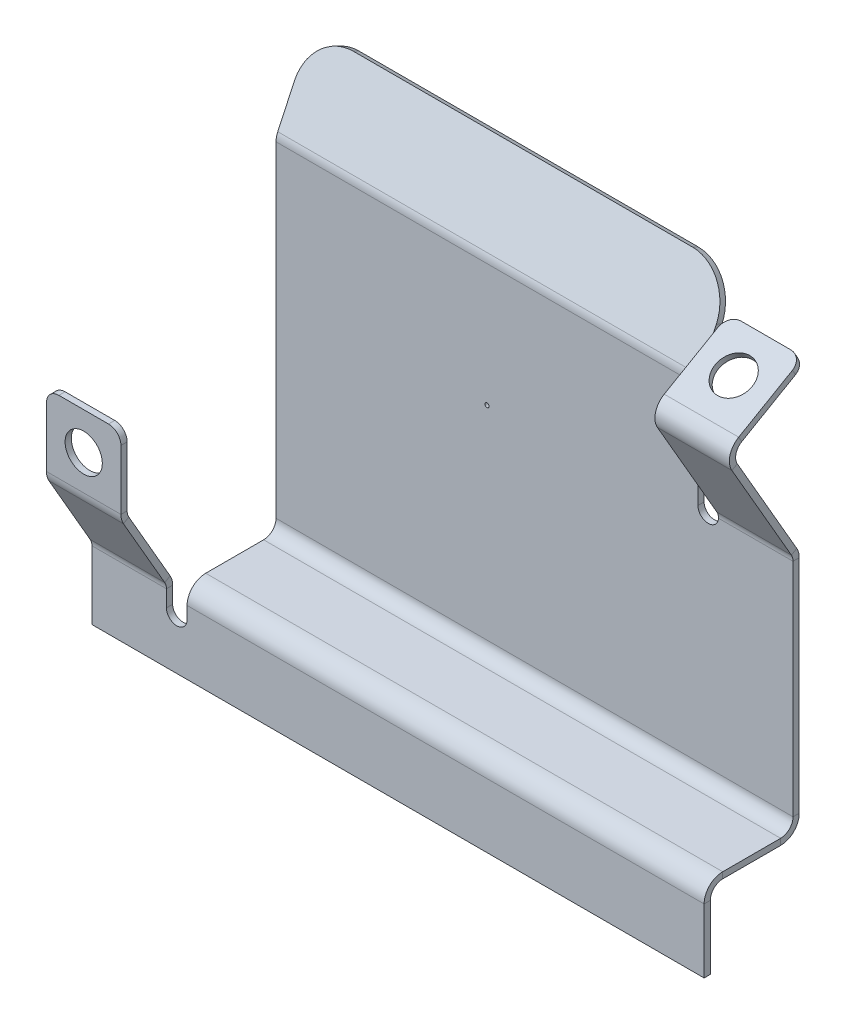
ISO-10303-21;
HEADER;
FILE_DESCRIPTION(('STEP AP214'),'2;1');
FILE_NAME('part.step','',(''),(''),'','','');
FILE_SCHEMA(('AUTOMOTIVE_DESIGN { 1 0 10303 214 1 1 1 1 }'));
ENDSEC;
DATA;
#1=APPLICATION_CONTEXT('core data for automotive mechanical design processes');
#2=APPLICATION_PROTOCOL_DEFINITION('international standard','automotive_design',2000,#1);
#3=PRODUCT_CONTEXT('',#1,'mechanical');
#4=PRODUCT('Part','Part','',(#3));
#5=PRODUCT_RELATED_PRODUCT_CATEGORY('part','',(#4));
#6=PRODUCT_DEFINITION_FORMATION('','',#4);
#7=PRODUCT_DEFINITION_CONTEXT('part definition',#1,'design');
#8=PRODUCT_DEFINITION('design','',#6,#7);
#9=PRODUCT_DEFINITION_SHAPE('','',#8);
#10=(LENGTH_UNIT() NAMED_UNIT(*) SI_UNIT(.MILLI.,.METRE.));
#11=(NAMED_UNIT(*) PLANE_ANGLE_UNIT() SI_UNIT($,.RADIAN.));
#12=(NAMED_UNIT(*) SI_UNIT($,.STERADIAN.) SOLID_ANGLE_UNIT());
#13=UNCERTAINTY_MEASURE_WITH_UNIT(LENGTH_MEASURE(1.E-05),#10,'distance_accuracy_value','');
#14=(GEOMETRIC_REPRESENTATION_CONTEXT(3) GLOBAL_UNCERTAINTY_ASSIGNED_CONTEXT((#13)) GLOBAL_UNIT_ASSIGNED_CONTEXT((#10,
#11,#12)) REPRESENTATION_CONTEXT('',''));
#15=CARTESIAN_POINT('',(0.,0.,0.));
#16=DIRECTION('',(0.,0.,1.));
#17=DIRECTION('',(1.,0.,0.));
#18=AXIS2_PLACEMENT_3D('',#15,#16,#17);
#19=CARTESIAN_POINT('',(-71.,-27.1511561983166,18.7593067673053));
#20=DIRECTION('',(0.,0.500000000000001,-0.866025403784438));
#21=DIRECTION('',(-1.,0.,0.));
#22=AXIS2_PLACEMENT_3D('',#19,#20,#21);
#23=PLANE('',#22);
#24=DIRECTION('',(0.,-0.866025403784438,-0.500000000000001));
#25=VECTOR('',#24,1.);
#26=CARTESIAN_POINT('',(-74.,-74.5210137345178,-8.58969323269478));
#27=LINE('',#26,#25);
#28=CARTESIAN_POINT('',(-74.,-41.2871521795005,10.5978856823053));
#29=VERTEX_POINT('',#28);
#30=CARTESIAN_POINT('',(-74.,-58.599,0.602885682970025));
#31=VERTEX_POINT('',#30);
#32=EDGE_CURVE('E86',#29,#31,#27,.T.);
#33=ORIENTED_EDGE('',*,*,#32,.F.);
#34=DIRECTION('',(1.,0.,0.));
#35=VECTOR('',#34,1.);
#36=CARTESIAN_POINT('',(-71.,-41.2871521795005,10.5978856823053));
#37=LINE('',#36,#35);
#38=CARTESIAN_POINT('',(-56.,-41.2871521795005,10.5978856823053));
#39=VERTEX_POINT('',#38);
#40=EDGE_CURVE('E78',#29,#39,#37,.T.);
#41=ORIENTED_EDGE('',*,*,#40,.T.);
#42=DIRECTION('',(0.,0.866025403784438,0.500000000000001));
#43=VECTOR('',#42,1.);
#44=CARTESIAN_POINT('',(-56.,-27.1511561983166,18.7593067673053));
#45=LINE('',#44,#43);
#46=CARTESIAN_POINT('',(-56.,-58.599,0.602885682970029));
#47=VERTEX_POINT('',#46);
#48=EDGE_CURVE('E94',#47,#39,#45,.T.);
#49=ORIENTED_EDGE('',*,*,#48,.F.);
#50=DIRECTION('',(1.,0.,0.));
#51=VECTOR('',#50,1.);
#52=CARTESIAN_POINT('',(-71.,-58.599,0.602885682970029));
#53=LINE('',#52,#51);
#54=EDGE_CURVE('E418',#31,#47,#53,.T.);
#55=ORIENTED_EDGE('',*,*,#54,.F.);
#56=EDGE_LOOP('',(#33,#41,#49,#55));
#57=FACE_BOUND('',#56,.T.);
#58=ADVANCED_FACE('F69',(#57),#23,.T.);
#59=CARTESIAN_POINT('',(-71.,-22.651,0.));
#60=DIRECTION('',(0.,0.,-1.));
#61=DIRECTION('',(-1.,0.,0.));
#62=AXIS2_PLACEMENT_3D('',#59,#60,#61);
#63=PLANE('',#62);
#64=DIRECTION('',(0.,-1.,0.));
#65=VECTOR('',#64,1.);
#66=CARTESIAN_POINT('',(-74.,-77.349,0.));
#67=LINE('',#66,#65);
#68=CARTESIAN_POINT('',(-74.,-60.849,0.));
#69=VERTEX_POINT('',#68);
#70=CARTESIAN_POINT('',(-74.,-77.349,0.));
#71=VERTEX_POINT('',#70);
#72=EDGE_CURVE('E751',#69,#71,#67,.T.);
#73=ORIENTED_EDGE('',*,*,#72,.F.);
#74=DIRECTION('',(1.,0.,0.));
#75=VECTOR('',#74,1.);
#76=CARTESIAN_POINT('',(-71.,-60.849,0.));
#77=LINE('',#76,#75);
#78=CARTESIAN_POINT('',(-56.,-60.849,0.));
#79=VERTEX_POINT('',#78);
#80=EDGE_CURVE('E1812',#69,#79,#77,.T.);
#81=ORIENTED_EDGE('',*,*,#80,.T.);
#82=DIRECTION('',(0.,1.,0.));
#83=VECTOR('',#82,1.);
#84=CARTESIAN_POINT('',(-56.,-22.651,0.));
#85=LINE('',#84,#83);
#86=CARTESIAN_POINT('',(-56.,-64.849,0.));
#87=VERTEX_POINT('',#86);
#88=EDGE_CURVE('E747',#87,#79,#85,.T.);
#89=ORIENTED_EDGE('',*,*,#88,.F.);
#90=CARTESIAN_POINT('',(-53.5,-64.849,0.));
#91=DIRECTION('',(0.,0.,-1.));
#92=DIRECTION('',(1.,0.,0.));
#93=AXIS2_PLACEMENT_3D('',#90,#91,#92);
#94=CIRCLE('',#93,2.5);
#95=CARTESIAN_POINT('',(-51.,-64.849,0.));
#96=VERTEX_POINT('',#95);
#97=EDGE_CURVE('E742',#96,#87,#94,.T.);
#98=ORIENTED_EDGE('',*,*,#97,.F.);
#99=DIRECTION('',(0.,-1.,0.));
#100=VECTOR('',#99,1.);
#101=CARTESIAN_POINT('',(-51.,-64.849,0.));
#102=LINE('',#101,#100);
#103=CARTESIAN_POINT('',(-51.,-61.849,0.));
#104=VERTEX_POINT('',#103);
#105=EDGE_CURVE('E726',#104,#96,#102,.T.);
#106=ORIENTED_EDGE('',*,*,#105,.F.);
#107=DIRECTION('',(1.,0.,0.));
#108=VECTOR('',#107,1.);
#109=CARTESIAN_POINT('',(-71.,-61.849,0.));
#110=LINE('',#109,#108);
#111=CARTESIAN_POINT('',(74.,-61.849,0.));
#112=VERTEX_POINT('',#111);
#113=EDGE_CURVE('E723',#104,#112,#110,.T.);
#114=ORIENTED_EDGE('',*,*,#113,.T.);
#115=DIRECTION('',(0.,1.,0.));
#116=VECTOR('',#115,1.);
#117=CARTESIAN_POINT('',(74.,68.272,0.));
#118=LINE('',#117,#116);
#119=CARTESIAN_POINT('',(74.,-77.349,0.));
#120=VERTEX_POINT('',#119);
#121=EDGE_CURVE('E717',#120,#112,#118,.T.);
#122=ORIENTED_EDGE('',*,*,#121,.F.);
#123=DIRECTION('',(1.,0.,0.));
#124=VECTOR('',#123,1.);
#125=CARTESIAN_POINT('',(74.,-77.349,0.));
#126=LINE('',#125,#124);
#127=EDGE_CURVE('E752',#71,#120,#126,.T.);
#128=ORIENTED_EDGE('',*,*,#127,.F.);
#129=EDGE_LOOP('',(#73,#81,#89,#98,#106,#114,#122,#128));
#130=FACE_BOUND('',#129,.T.);
#131=ADVANCED_FACE('F873',(#130),#63,.T.);
#132=CARTESIAN_POINT('',(-71.,-34.5374129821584,-41.6461667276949));
#133=DIRECTION('',(0.,0.500000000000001,-0.866025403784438));
#134=DIRECTION('',(-1.,0.,0.));
#135=AXIS2_PLACEMENT_3D('',#132,#133,#134);
#136=PLANE('',#135);
#137=DIRECTION('',(0.,-0.866025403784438,-0.500000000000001));
#138=VECTOR('',#137,1.);
#139=CARTESIAN_POINT('',(56.,-0.0678698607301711,-21.7451667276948));
#140=LINE('',#139,#138);
#141=CARTESIAN_POINT('',(56.,26.3168242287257,-6.51195649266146));
#142=VERTEX_POINT('',#141);
#143=CARTESIAN_POINT('',(56.,1.40100000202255,-20.89711431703));
#144=VERTEX_POINT('',#143);
#145=EDGE_CURVE('E507',#142,#144,#140,.T.);
#146=ORIENTED_EDGE('',*,*,#145,.F.);
#147=DIRECTION('',(1.,0.,0.));
#148=VECTOR('',#147,1.);
#149=CARTESIAN_POINT('',(-71.,26.3168242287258,-6.51195649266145));
#150=LINE('',#149,#148);
#151=CARTESIAN_POINT('',(74.,26.3168242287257,-6.51195649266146));
#152=VERTEX_POINT('',#151);
#153=EDGE_CURVE('E1834',#142,#152,#150,.T.);
#154=ORIENTED_EDGE('',*,*,#153,.T.);
#155=DIRECTION('',(0.,0.866025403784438,0.500000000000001));
#156=VECTOR('',#155,1.);
#157=CARTESIAN_POINT('',(74.,44.2042148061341,3.81533327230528));
#158=LINE('',#157,#156);
#159=CARTESIAN_POINT('',(74.,1.40100000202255,-20.89711431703));
#160=VERTEX_POINT('',#159);
#161=EDGE_CURVE('E511',#160,#152,#158,.T.);
#162=ORIENTED_EDGE('',*,*,#161,.F.);
#163=DIRECTION('',(1.,0.,0.));
#164=VECTOR('',#163,1.);
#165=CARTESIAN_POINT('',(-71.,1.40100000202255,-20.89711431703));
#166=LINE('',#165,#164);
#167=EDGE_CURVE('E502',#144,#160,#166,.T.);
#168=ORIENTED_EDGE('',*,*,#167,.F.);
#169=EDGE_LOOP('',(#146,#154,#162,#168));
#170=FACE_BOUND('',#169,.T.);
#171=ADVANCED_FACE('F860',(#170),#136,.T.);
#172=CARTESIAN_POINT('',(-71.,-40.4619469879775,-21.5));
#173=DIRECTION('',(0.,0.,-1.));
#174=DIRECTION('',(-1.,0.,0.));
#175=AXIS2_PLACEMENT_3D('',#172,#173,#174);
#176=PLANE('',#175);
#177=CARTESIAN_POINT('',(0.,-5.15994698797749,-21.5));
#178=DIRECTION('',(0.,0.,1.));
#179=DIRECTION('',(1.,0.,0.));
#180=AXIS2_PLACEMENT_3D('',#177,#178,#179);
#181=CIRCLE('',#180,0.5);
#182=CARTESIAN_POINT('',(0.5,-5.15994698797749,-21.5));
#183=VERTEX_POINT('',#182);
#184=EDGE_CURVE('E672',#183,#183,#181,.T.);
#185=ORIENTED_EDGE('',*,*,#184,.T.);
#186=EDGE_LOOP('',(#185));
#187=FACE_BOUND('',#186,.T.);
#188=CARTESIAN_POINT('',(53.5,-0.6599469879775,-21.5));
#189=DIRECTION('',(0.,0.,-1.));
#190=DIRECTION('',(1.,0.,0.));
#191=AXIS2_PLACEMENT_3D('',#188,#189,#190);
#192=CIRCLE('',#191,2.5);
#193=CARTESIAN_POINT('',(55.9928415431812,-0.848999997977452,-21.5));
#194=VERTEX_POINT('',#193);
#195=CARTESIAN_POINT('',(51.,-0.6599469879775,-21.5));
#196=VERTEX_POINT('',#195);
#197=EDGE_CURVE('E687',#194,#196,#192,.T.);
#198=ORIENTED_EDGE('',*,*,#197,.F.);
#199=DIRECTION('',(1.,0.,0.));
#200=VECTOR('',#199,1.);
#201=CARTESIAN_POINT('',(-71.,-0.848999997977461,-21.5));
#202=LINE('',#201,#200);
#203=CARTESIAN_POINT('',(74.,-0.848999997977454,-21.5));
#204=VERTEX_POINT('',#203);
#205=EDGE_CURVE('E814',#194,#204,#202,.T.);
#206=ORIENTED_EDGE('',*,*,#205,.T.);
#207=DIRECTION('',(0.,1.,0.));
#208=VECTOR('',#207,1.);
#209=CARTESIAN_POINT('',(74.,50.4610530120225,-21.5));
#210=LINE('',#209,#208);
#211=CARTESIAN_POINT('',(74.,-54.349,-21.5));
#212=VERTEX_POINT('',#211);
#213=EDGE_CURVE('E675',#212,#204,#210,.T.);
#214=ORIENTED_EDGE('',*,*,#213,.F.);
#215=DIRECTION('',(1.,0.,0.));
#216=VECTOR('',#215,1.);
#217=CARTESIAN_POINT('',(-71.,-54.3490000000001,-21.5));
#218=LINE('',#217,#216);
#219=CARTESIAN_POINT('',(-51.,-54.3490000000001,-21.5));
#220=VERTEX_POINT('',#219);
#221=EDGE_CURVE('E666',#220,#212,#218,.T.);
#222=ORIENTED_EDGE('',*,*,#221,.F.);
#223=DIRECTION('',(0.,-1.,0.));
#224=VECTOR('',#223,1.);
#225=CARTESIAN_POINT('',(-51.,-82.6599469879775,-21.5));
#226=LINE('',#225,#224);
#227=CARTESIAN_POINT('',(-51.,24.4860530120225,-21.5));
#228=VERTEX_POINT('',#227);
#229=EDGE_CURVE('E671',#228,#220,#226,.T.);
#230=ORIENTED_EDGE('',*,*,#229,.F.);
#231=DIRECTION('',(1.,0.,0.));
#232=VECTOR('',#231,1.);
#233=CARTESIAN_POINT('',(-71.,24.4860530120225,-21.5));
#234=LINE('',#233,#232);
#235=CARTESIAN_POINT('',(51.,24.4860530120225,-21.5));
#236=VERTEX_POINT('',#235);
#237=EDGE_CURVE('E799',#228,#236,#234,.T.);
#238=ORIENTED_EDGE('',*,*,#237,.T.);
#239=DIRECTION('',(0.,1.,0.));
#240=VECTOR('',#239,1.);
#241=CARTESIAN_POINT('',(51.,35.6100530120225,-21.5));
#242=LINE('',#241,#240);
#243=EDGE_CURVE('E691',#196,#236,#242,.T.);
#244=ORIENTED_EDGE('',*,*,#243,.F.);
#245=EDGE_LOOP('',(#198,#206,#214,#222,#230,#238,#244));
#246=FACE_BOUND('',#245,.T.);
#247=ADVANCED_FACE('F856',(#187,#246),#176,.T.);
#248=CARTESIAN_POINT('',(-71.,-58.8490000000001,-36.5425265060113));
#249=DIRECTION('',(0.,-1.,0.));
#250=DIRECTION('',(-1.,0.,0.));
#251=AXIS2_PLACEMENT_3D('',#248,#249,#250);
#252=PLANE('',#251);
#253=DIRECTION('',(0.,0.,1.));
#254=VECTOR('',#253,1.);
#255=CARTESIAN_POINT('',(-51.,-58.849,5.65547349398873));
#256=LINE('',#255,#254);
#257=CARTESIAN_POINT('',(-51.,-58.8490000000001,-17.));
#258=VERTEX_POINT('',#257);
#259=CARTESIAN_POINT('',(-51.,-58.8490000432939,-3.00000000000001));
#260=VERTEX_POINT('',#259);
#261=EDGE_CURVE('E788',#258,#260,#256,.T.);
#262=ORIENTED_EDGE('',*,*,#261,.F.);
#263=DIRECTION('',(1.,0.,0.));
#264=VECTOR('',#263,1.);
#265=CARTESIAN_POINT('',(-71.,-58.8490000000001,-17.));
#266=LINE('',#265,#264);
#267=CARTESIAN_POINT('',(74.,-58.8490000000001,-17.));
#268=VERTEX_POINT('',#267);
#269=EDGE_CURVE('E781',#258,#268,#266,.T.);
#270=ORIENTED_EDGE('',*,*,#269,.T.);
#271=DIRECTION('',(0.,0.,-1.));
#272=VECTOR('',#271,1.);
#273=CARTESIAN_POINT('',(74.,-58.8490000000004,-127.465526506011));
#274=LINE('',#273,#272);
#275=CARTESIAN_POINT('',(74.,-58.8490000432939,-3.00000000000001));
#276=VERTEX_POINT('',#275);
#277=EDGE_CURVE('E719',#276,#268,#274,.T.);
#278=ORIENTED_EDGE('',*,*,#277,.F.);
#279=DIRECTION('',(1.,0.,0.));
#280=VECTOR('',#279,1.);
#281=CARTESIAN_POINT('',(-71.,-58.849,-3.00000000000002));
#282=LINE('',#281,#280);
#283=EDGE_CURVE('E770',#260,#276,#282,.T.);
#284=ORIENTED_EDGE('',*,*,#283,.F.);
#285=EDGE_LOOP('',(#262,#270,#278,#284));
#286=FACE_BOUND('',#285,.T.);
#287=ADVANCED_FACE('F859',(#286),#252,.T.);
#288=CARTESIAN_POINT('',(-71.,-57.3490000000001,-36.5425265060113));
#289=DIRECTION('',(0.,-1.,0.));
#290=DIRECTION('',(-1.,0.,0.));
#291=AXIS2_PLACEMENT_3D('',#288,#289,#290);
#292=PLANE('',#291);
#293=DIRECTION('',(1.,0.,0.));
#294=VECTOR('',#293,1.);
#295=CARTESIAN_POINT('',(-71.,-57.3490000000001,-17.));
#296=LINE('',#295,#294);
#297=CARTESIAN_POINT('',(-51.,-57.34900000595,-17.));
#298=VERTEX_POINT('',#297);
#299=CARTESIAN_POINT('',(74.,-57.3490000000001,-17.));
#300=VERTEX_POINT('',#299);
#301=EDGE_CURVE('E775',#298,#300,#296,.T.);
#302=ORIENTED_EDGE('',*,*,#301,.F.);
#303=DIRECTION('',(0.,0.,1.));
#304=VECTOR('',#303,1.);
#305=CARTESIAN_POINT('',(-51.,-57.349,5.65547349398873));
#306=LINE('',#305,#304);
#307=CARTESIAN_POINT('',(-51.,-57.3490000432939,-3.00000000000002));
#308=VERTEX_POINT('',#307);
#309=EDGE_CURVE('E767',#298,#308,#306,.T.);
#310=ORIENTED_EDGE('',*,*,#309,.T.);
#311=DIRECTION('',(1.,0.,0.));
#312=VECTOR('',#311,1.);
#313=CARTESIAN_POINT('',(-71.,-57.349,-3.00000000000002));
#314=LINE('',#313,#312);
#315=CARTESIAN_POINT('',(74.,-57.349,-3.00000000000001));
#316=VERTEX_POINT('',#315);
#317=EDGE_CURVE('E763',#308,#316,#314,.T.);
#318=ORIENTED_EDGE('',*,*,#317,.T.);
#319=DIRECTION('',(0.,0.,-1.));
#320=VECTOR('',#319,1.);
#321=CARTESIAN_POINT('',(74.,-57.3490000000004,-127.465526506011));
#322=LINE('',#321,#320);
#323=EDGE_CURVE('E790',#316,#300,#322,.T.);
#324=ORIENTED_EDGE('',*,*,#323,.T.);
#325=EDGE_LOOP('',(#302,#310,#318,#324));
#326=FACE_BOUND('',#325,.T.);
#327=ADVANCED_FACE('F933',(#326),#292,.F.);
#328=CARTESIAN_POINT('',(74.,-57.3490000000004,-127.465526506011));
#329=DIRECTION('',(-1.,0.,0.));
#330=DIRECTION('',(0.,0.,1.));
#331=AXIS2_PLACEMENT_3D('',#328,#329,#330);
#332=PLANE('',#331);
#333=DIRECTION('',(0.,-1.,0.));
#334=VECTOR('',#333,1.);
#335=CARTESIAN_POINT('',(74.,-57.3490000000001,-17.));
#336=LINE('',#335,#334);
#337=EDGE_CURVE('E778',#300,#268,#336,.T.);
#338=ORIENTED_EDGE('',*,*,#337,.F.);
#339=ORIENTED_EDGE('',*,*,#323,.F.);
#340=DIRECTION('',(0.,-1.,0.));
#341=VECTOR('',#340,1.);
#342=CARTESIAN_POINT('',(74.,-57.349,-3.00000000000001));
#343=LINE('',#342,#341);
#344=EDGE_CURVE('E772',#316,#276,#343,.T.);
#345=ORIENTED_EDGE('',*,*,#344,.T.);
#346=ORIENTED_EDGE('',*,*,#277,.T.);
#347=EDGE_LOOP('',(#338,#339,#345,#346));
#348=FACE_BOUND('',#347,.T.);
#349=ADVANCED_FACE('F942',(#348),#332,.F.);
#350=CARTESIAN_POINT('',(-51.,-57.349,5.65547349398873));
#351=DIRECTION('',(1.,0.,0.));
#352=DIRECTION('',(0.,0.,-1.));
#353=AXIS2_PLACEMENT_3D('',#350,#351,#352);
#354=PLANE('',#353);
#355=DIRECTION('',(0.,1.,0.));
#356=VECTOR('',#355,1.);
#357=CARTESIAN_POINT('',(-51.,-57.3490000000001,-17.));
#358=LINE('',#357,#356);
#359=EDGE_CURVE('E784',#258,#298,#358,.T.);
#360=ORIENTED_EDGE('',*,*,#359,.F.);
#361=ORIENTED_EDGE('',*,*,#261,.T.);
#362=DIRECTION('',(0.,1.,0.));
#363=VECTOR('',#362,1.);
#364=CARTESIAN_POINT('',(-51.,-57.349,-3.00000000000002));
#365=LINE('',#364,#363);
#366=EDGE_CURVE('E766',#260,#308,#365,.T.);
#367=ORIENTED_EDGE('',*,*,#366,.T.);
#368=ORIENTED_EDGE('',*,*,#309,.F.);
#369=EDGE_LOOP('',(#360,#361,#367,#368));
#370=FACE_BOUND('',#369,.T.);
#371=ADVANCED_FACE('F950',(#370),#354,.F.);
#372=CARTESIAN_POINT('',(74.,-77.349,1.5));
#373=DIRECTION('',(0.,1.,0.));
#374=DIRECTION('',(-1.,0.,0.));
#375=AXIS2_PLACEMENT_3D('',#372,#373,#374);
#376=PLANE('',#375);
#377=ORIENTED_EDGE('',*,*,#127,.T.);
#378=DIRECTION('',(0.,0.,-1.));
#379=VECTOR('',#378,1.);
#380=CARTESIAN_POINT('',(74.,-77.349,1.5));
#381=LINE('',#380,#379);
#382=CARTESIAN_POINT('',(74.,-77.349,1.5));
#383=VERTEX_POINT('',#382);
#384=EDGE_CURVE('E720',#383,#120,#381,.T.);
#385=ORIENTED_EDGE('',*,*,#384,.F.);
#386=DIRECTION('',(1.,0.,0.));
#387=VECTOR('',#386,1.);
#388=CARTESIAN_POINT('',(74.,-77.349,1.5));
#389=LINE('',#388,#387);
#390=CARTESIAN_POINT('',(-74.,-77.349,1.5));
#391=VERTEX_POINT('',#390);
#392=EDGE_CURVE('E730',#391,#383,#389,.T.);
#393=ORIENTED_EDGE('',*,*,#392,.F.);
#394=DIRECTION('',(0.,0.,-1.));
#395=VECTOR('',#394,1.);
#396=CARTESIAN_POINT('',(-74.,-77.349,1.5));
#397=LINE('',#396,#395);
#398=EDGE_CURVE('E748',#391,#71,#397,.T.);
#399=ORIENTED_EDGE('',*,*,#398,.T.);
#400=EDGE_LOOP('',(#377,#385,#393,#399));
#401=FACE_BOUND('',#400,.T.);
#402=ADVANCED_FACE('F895',(#401),#376,.F.);
#403=CARTESIAN_POINT('',(-74.,-77.349,1.5));
#404=DIRECTION('',(1.,0.,0.));
#405=DIRECTION('',(0.,1.,0.));
#406=AXIS2_PLACEMENT_3D('',#403,#404,#405);
#407=PLANE('',#406);
#408=DIRECTION('',(0.,0.,1.));
#409=VECTOR('',#408,1.);
#410=CARTESIAN_POINT('',(-74.,-60.849,1.5));
#411=LINE('',#410,#409);
#412=CARTESIAN_POINT('',(-74.,-60.849,1.50000003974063));
#413=VERTEX_POINT('',#412);
#414=EDGE_CURVE('E1787',#69,#413,#411,.T.);
#415=ORIENTED_EDGE('',*,*,#414,.F.);
#416=ORIENTED_EDGE('',*,*,#72,.T.);
#417=ORIENTED_EDGE('',*,*,#398,.F.);
#418=DIRECTION('',(0.,-1.,0.));
#419=VECTOR('',#418,1.);
#420=CARTESIAN_POINT('',(-74.,-77.349,1.5));
#421=LINE('',#420,#419);
#422=EDGE_CURVE('E733',#413,#391,#421,.T.);
#423=ORIENTED_EDGE('',*,*,#422,.F.);
#424=EDGE_LOOP('',(#415,#416,#417,#423));
#425=FACE_BOUND('',#424,.T.);
#426=ADVANCED_FACE('F888',(#425),#407,.F.);
#427=CARTESIAN_POINT('',(-56.,-22.651,1.5));
#428=DIRECTION('',(-1.,0.,0.));
#429=DIRECTION('',(0.,-1.,0.));
#430=AXIS2_PLACEMENT_3D('',#427,#428,#429);
#431=PLANE('',#430);
#432=DIRECTION('',(0.,0.,-1.));
#433=VECTOR('',#432,1.);
#434=CARTESIAN_POINT('',(-56.,-60.849,1.5));
#435=LINE('',#434,#433);
#436=CARTESIAN_POINT('',(-56.,-60.849,1.5));
#437=VERTEX_POINT('',#436);
#438=EDGE_CURVE('E1821',#437,#79,#435,.T.);
#439=ORIENTED_EDGE('',*,*,#438,.F.);
#440=DIRECTION('',(0.,1.,0.));
#441=VECTOR('',#440,1.);
#442=CARTESIAN_POINT('',(-56.,-22.651,1.5));
#443=LINE('',#442,#441);
#444=CARTESIAN_POINT('',(-56.,-64.849,1.5));
#445=VERTEX_POINT('',#444);
#446=EDGE_CURVE('E736',#445,#437,#443,.T.);
#447=ORIENTED_EDGE('',*,*,#446,.F.);
#448=DIRECTION('',(0.,0.,-1.));
#449=VECTOR('',#448,1.);
#450=CARTESIAN_POINT('',(-56.,-64.849,1.5));
#451=LINE('',#450,#449);
#452=EDGE_CURVE('E744',#445,#87,#451,.T.);
#453=ORIENTED_EDGE('',*,*,#452,.T.);
#454=ORIENTED_EDGE('',*,*,#88,.T.);
#455=EDGE_LOOP('',(#439,#447,#453,#454));
#456=FACE_BOUND('',#455,.T.);
#457=ADVANCED_FACE('F885',(#456),#431,.F.);
#458=CARTESIAN_POINT('',(-53.5,-64.849,1.5));
#459=DIRECTION('',(0.,0.,-1.));
#460=DIRECTION('',(-1.,0.,0.));
#461=AXIS2_PLACEMENT_3D('',#458,#459,#460);
#462=CYLINDRICAL_SURFACE('',#461,2.5);
#463=ORIENTED_EDGE('',*,*,#97,.T.);
#464=ORIENTED_EDGE('',*,*,#452,.F.);
#465=CARTESIAN_POINT('',(-53.5,-64.849,1.5));
#466=DIRECTION('',(0.,0.,-1.));
#467=DIRECTION('',(1.,0.,0.));
#468=AXIS2_PLACEMENT_3D('',#465,#466,#467);
#469=CIRCLE('',#468,2.5);
#470=CARTESIAN_POINT('',(-51.,-64.849,1.5));
#471=VERTEX_POINT('',#470);
#472=EDGE_CURVE('E734',#471,#445,#469,.T.);
#473=ORIENTED_EDGE('',*,*,#472,.F.);
#474=DIRECTION('',(0.,0.,-1.));
#475=VECTOR('',#474,1.);
#476=CARTESIAN_POINT('',(-51.,-64.849,1.5));
#477=LINE('',#476,#475);
#478=EDGE_CURVE('E739',#471,#96,#477,.T.);
#479=ORIENTED_EDGE('',*,*,#478,.T.);
#480=EDGE_LOOP('',(#463,#464,#473,#479));
#481=FACE_BOUND('',#480,.T.);
#482=ADVANCED_FACE('F883',(#481),#462,.F.);
#483=CARTESIAN_POINT('',(-71.,-22.651,1.5));
#484=DIRECTION('',(0.,0.,-1.));
#485=DIRECTION('',(-1.,0.,0.));
#486=AXIS2_PLACEMENT_3D('',#483,#484,#485);
#487=PLANE('',#486);
#488=DIRECTION('',(1.,0.,0.));
#489=VECTOR('',#488,1.);
#490=CARTESIAN_POINT('',(-71.,-60.849,1.5));
#491=LINE('',#490,#489);
#492=EDGE_CURVE('E1824',#413,#437,#491,.T.);
#493=ORIENTED_EDGE('',*,*,#492,.F.);
#494=ORIENTED_EDGE('',*,*,#422,.T.);
#495=ORIENTED_EDGE('',*,*,#392,.T.);
#496=DIRECTION('',(0.,1.,0.));
#497=VECTOR('',#496,1.);
#498=CARTESIAN_POINT('',(74.,68.272,1.5));
#499=LINE('',#498,#497);
#500=CARTESIAN_POINT('',(74.,-61.849,1.5));
#501=VERTEX_POINT('',#500);
#502=EDGE_CURVE('E728',#383,#501,#499,.T.);
#503=ORIENTED_EDGE('',*,*,#502,.T.);
#504=DIRECTION('',(1.,0.,0.));
#505=VECTOR('',#504,1.);
#506=CARTESIAN_POINT('',(-71.,-61.849,1.5));
#507=LINE('',#506,#505);
#508=CARTESIAN_POINT('',(-51.,-61.849,1.49999997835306));
#509=VERTEX_POINT('',#508);
#510=EDGE_CURVE('E716',#509,#501,#507,.T.);
#511=ORIENTED_EDGE('',*,*,#510,.F.);
#512=DIRECTION('',(0.,-1.,0.));
#513=VECTOR('',#512,1.);
#514=CARTESIAN_POINT('',(-51.,-64.849,1.5));
#515=LINE('',#514,#513);
#516=EDGE_CURVE('E737',#509,#471,#515,.T.);
#517=ORIENTED_EDGE('',*,*,#516,.T.);
#518=ORIENTED_EDGE('',*,*,#472,.T.);
#519=ORIENTED_EDGE('',*,*,#446,.T.);
#520=EDGE_LOOP('',(#493,#494,#495,#503,#511,#517,#518,#519));
#521=FACE_BOUND('',#520,.T.);
#522=ADVANCED_FACE('F879',(#521),#487,.F.);
#523=CARTESIAN_POINT('',(-51.,-64.849,1.5));
#524=DIRECTION('',(1.,0.,0.));
#525=DIRECTION('',(0.,1.,0.));
#526=AXIS2_PLACEMENT_3D('',#523,#524,#525);
#527=PLANE('',#526);
#528=DIRECTION('',(0.,0.,1.));
#529=VECTOR('',#528,1.);
#530=CARTESIAN_POINT('',(-51.,-61.849,1.5));
#531=LINE('',#530,#529);
#532=EDGE_CURVE('E755',#104,#509,#531,.T.);
#533=ORIENTED_EDGE('',*,*,#532,.F.);
#534=ORIENTED_EDGE('',*,*,#105,.T.);
#535=ORIENTED_EDGE('',*,*,#478,.F.);
#536=ORIENTED_EDGE('',*,*,#516,.F.);
#537=EDGE_LOOP('',(#533,#534,#535,#536));
#538=FACE_BOUND('',#537,.T.);
#539=ADVANCED_FACE('F882',(#538),#527,.F.);
#540=CARTESIAN_POINT('',(74.,68.272,1.5));
#541=DIRECTION('',(-1.,0.,0.));
#542=DIRECTION('',(0.,-1.,0.));
#543=AXIS2_PLACEMENT_3D('',#540,#541,#542);
#544=PLANE('',#543);
#545=DIRECTION('',(0.,0.,-1.));
#546=VECTOR('',#545,1.);
#547=CARTESIAN_POINT('',(74.,-61.849,1.5));
#548=LINE('',#547,#546);
#549=EDGE_CURVE('E758',#501,#112,#548,.T.);
#550=ORIENTED_EDGE('',*,*,#549,.F.);
#551=ORIENTED_EDGE('',*,*,#502,.F.);
#552=ORIENTED_EDGE('',*,*,#384,.T.);
#553=ORIENTED_EDGE('',*,*,#121,.T.);
#554=EDGE_LOOP('',(#550,#551,#552,#553));
#555=FACE_BOUND('',#554,.T.);
#556=ADVANCED_FACE('F992',(#555),#544,.F.);
#557=CARTESIAN_POINT('',(-51.,-61.849,-2.99999995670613));
#558=DIRECTION('',(-1.,0.,0.));
#559=DIRECTION('',(0.,0.,1.));
#560=AXIS2_PLACEMENT_3D('',#557,#558,#559);
#561=PLANE('',#560);
#562=ORIENTED_EDGE('',*,*,#366,.F.);
#563=CARTESIAN_POINT('',(-51.,-61.849,-3.));
#564=DIRECTION('',(-1.,0.,0.));
#565=DIRECTION('',(0.,-1.,0.));
#566=AXIS2_PLACEMENT_3D('',#563,#564,#565);
#567=CIRCLE('',#566,2.99999995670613);
#568=EDGE_CURVE('E705',#260,#104,#567,.F.);
#569=ORIENTED_EDGE('',*,*,#568,.T.);
#570=ORIENTED_EDGE('',*,*,#532,.T.);
#571=CARTESIAN_POINT('',(-51.,-61.849,-2.99999995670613));
#572=DIRECTION('',(1.,0.,0.));
#573=DIRECTION('',(0.,0.,-1.));
#574=AXIS2_PLACEMENT_3D('',#571,#572,#573);
#575=CIRCLE('',#574,4.49999993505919);
#576=EDGE_CURVE('E711',#308,#509,#575,.T.);
#577=ORIENTED_EDGE('',*,*,#576,.F.);
#578=EDGE_LOOP('',(#562,#569,#570,#577));
#579=FACE_BOUND('',#578,.T.);
#580=ADVANCED_FACE('F1000',(#579),#561,.T.);
#581=CARTESIAN_POINT('',(74.,-61.849,-2.99999995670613));
#582=DIRECTION('',(1.,0.,0.));
#583=DIRECTION('',(0.,0.,-1.));
#584=AXIS2_PLACEMENT_3D('',#581,#582,#583);
#585=PLANE('',#584);
#586=CARTESIAN_POINT('',(74.,-61.849,-3.));
#587=DIRECTION('',(-1.,0.,0.));
#588=DIRECTION('',(0.,-1.,0.));
#589=AXIS2_PLACEMENT_3D('',#586,#587,#588);
#590=CIRCLE('',#589,2.99999995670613);
#591=EDGE_CURVE('E708',#112,#276,#590,.T.);
#592=ORIENTED_EDGE('',*,*,#591,.T.);
#593=ORIENTED_EDGE('',*,*,#344,.F.);
#594=CARTESIAN_POINT('',(74.,-61.849,-2.99999995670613));
#595=DIRECTION('',(-1.,0.,0.));
#596=DIRECTION('',(0.,0.,1.));
#597=AXIS2_PLACEMENT_3D('',#594,#595,#596);
#598=CIRCLE('',#597,4.49999993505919);
#599=EDGE_CURVE('E714',#501,#316,#598,.T.);
#600=ORIENTED_EDGE('',*,*,#599,.F.);
#601=ORIENTED_EDGE('',*,*,#549,.T.);
#602=EDGE_LOOP('',(#592,#593,#600,#601));
#603=FACE_BOUND('',#602,.T.);
#604=ADVANCED_FACE('F1008',(#603),#585,.T.);
#605=CARTESIAN_POINT('',(136.636862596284,-61.849,-3.));
#606=DIRECTION('',(-1.,0.,0.));
#607=DIRECTION('',(0.,-1.,0.));
#608=AXIS2_PLACEMENT_3D('',#605,#606,#607);
#609=CYLINDRICAL_SURFACE('',#608,4.49999995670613);
#610=ORIENTED_EDGE('',*,*,#510,.T.);
#611=ORIENTED_EDGE('',*,*,#599,.T.);
#612=ORIENTED_EDGE('',*,*,#317,.F.);
#613=ORIENTED_EDGE('',*,*,#576,.T.);
#614=EDGE_LOOP('',(#610,#611,#612,#613));
#615=FACE_BOUND('',#614,.T.);
#616=ADVANCED_FACE('F1011',(#615),#609,.T.);
#617=CARTESIAN_POINT('',(136.636862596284,-61.849,-3.));
#618=DIRECTION('',(-1.,0.,0.));
#619=DIRECTION('',(0.,-1.,0.));
#620=AXIS2_PLACEMENT_3D('',#617,#618,#619);
#621=CYLINDRICAL_SURFACE('',#620,2.99999995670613);
#622=ORIENTED_EDGE('',*,*,#113,.F.);
#623=ORIENTED_EDGE('',*,*,#568,.F.);
#624=ORIENTED_EDGE('',*,*,#283,.T.);
#625=ORIENTED_EDGE('',*,*,#591,.F.);
#626=EDGE_LOOP('',(#622,#623,#624,#625));
#627=FACE_BOUND('',#626,.T.);
#628=ADVANCED_FACE('F1019',(#627),#621,.F.);
#629=CARTESIAN_POINT('',(-51.,-54.3489999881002,-17.));
#630=DIRECTION('',(1.,0.,0.));
#631=DIRECTION('',(0.,0.,-1.));
#632=AXIS2_PLACEMENT_3D('',#629,#630,#631);
#633=PLANE('',#632);
#634=DIRECTION('',(0.,0.,1.));
#635=VECTOR('',#634,1.);
#636=CARTESIAN_POINT('',(-51.,-54.3490000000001,-20.));
#637=LINE('',#636,#635);
#638=CARTESIAN_POINT('',(-51.,-54.3490000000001,-20.0000000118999));
#639=VERTEX_POINT('',#638);
#640=EDGE_CURVE('E667',#220,#639,#637,.T.);
#641=ORIENTED_EDGE('',*,*,#640,.F.);
#642=CARTESIAN_POINT('',(-51.,-54.3490000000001,-17.));
#643=DIRECTION('',(-1.,0.,0.));
#644=DIRECTION('',(0.,0.,1.));
#645=AXIS2_PLACEMENT_3D('',#642,#643,#644);
#646=CIRCLE('',#645,4.50000001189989);
#647=EDGE_CURVE('E670',#220,#258,#646,.T.);
#648=ORIENTED_EDGE('',*,*,#647,.T.);
#649=ORIENTED_EDGE('',*,*,#359,.T.);
#650=CARTESIAN_POINT('',(-51.,-54.3489999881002,-17.));
#651=DIRECTION('',(-1.,0.,0.));
#652=DIRECTION('',(0.,0.,1.));
#653=AXIS2_PLACEMENT_3D('',#650,#651,#652);
#654=CIRCLE('',#653,3.00000001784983);
#655=EDGE_CURVE('E699',#639,#298,#654,.T.);
#656=ORIENTED_EDGE('',*,*,#655,.F.);
#657=EDGE_LOOP('',(#641,#648,#649,#656));
#658=FACE_BOUND('',#657,.T.);
#659=ADVANCED_FACE('F1031',(#658),#633,.F.);
#660=CARTESIAN_POINT('',(74.,-54.3489999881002,-17.));
#661=DIRECTION('',(-1.,0.,0.));
#662=DIRECTION('',(0.,0.,1.));
#663=AXIS2_PLACEMENT_3D('',#660,#661,#662);
#664=PLANE('',#663);
#665=CARTESIAN_POINT('',(74.,-54.3490000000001,-17.));
#666=DIRECTION('',(-1.,0.,0.));
#667=DIRECTION('',(0.,0.,1.));
#668=AXIS2_PLACEMENT_3D('',#665,#666,#667);
#669=CIRCLE('',#668,4.50000001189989);
#670=EDGE_CURVE('E696',#268,#212,#669,.F.);
#671=ORIENTED_EDGE('',*,*,#670,.T.);
#672=DIRECTION('',(0.,0.,-1.));
#673=VECTOR('',#672,1.);
#674=CARTESIAN_POINT('',(74.,-54.3490000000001,-20.));
#675=LINE('',#674,#673);
#676=CARTESIAN_POINT('',(74.,-54.349,-20.));
#677=VERTEX_POINT('',#676);
#678=EDGE_CURVE('E676',#677,#212,#675,.T.);
#679=ORIENTED_EDGE('',*,*,#678,.F.);
#680=CARTESIAN_POINT('',(74.,-54.3489999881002,-17.));
#681=DIRECTION('',(1.,0.,0.));
#682=DIRECTION('',(0.,0.,-1.));
#683=AXIS2_PLACEMENT_3D('',#680,#681,#682);
#684=CIRCLE('',#683,3.00000001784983);
#685=EDGE_CURVE('E702',#300,#677,#684,.T.);
#686=ORIENTED_EDGE('',*,*,#685,.F.);
#687=ORIENTED_EDGE('',*,*,#337,.T.);
#688=EDGE_LOOP('',(#671,#679,#686,#687));
#689=FACE_BOUND('',#688,.T.);
#690=ADVANCED_FACE('F1038',(#689),#664,.F.);
#691=CARTESIAN_POINT('',(136.636862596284,-54.349,-17.));
#692=DIRECTION('',(-1.,0.,0.));
#693=DIRECTION('',(0.,0.,1.));
#694=AXIS2_PLACEMENT_3D('',#691,#692,#693);
#695=CYLINDRICAL_SURFACE('',#694,3.00000001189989);
#696=ORIENTED_EDGE('',*,*,#301,.T.);
#697=ORIENTED_EDGE('',*,*,#685,.T.);
#698=DIRECTION('',(1.,0.,0.));
#699=VECTOR('',#698,1.);
#700=CARTESIAN_POINT('',(-71.,-54.3490000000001,-20.));
#701=LINE('',#700,#699);
#702=EDGE_CURVE('E680',#639,#677,#701,.T.);
#703=ORIENTED_EDGE('',*,*,#702,.F.);
#704=ORIENTED_EDGE('',*,*,#655,.T.);
#705=EDGE_LOOP('',(#696,#697,#703,#704));
#706=FACE_BOUND('',#705,.T.);
#707=ADVANCED_FACE('F1041',(#706),#695,.F.);
#708=CARTESIAN_POINT('',(136.636862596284,-54.349,-17.));
#709=DIRECTION('',(-1.,0.,0.));
#710=DIRECTION('',(0.,0.,1.));
#711=AXIS2_PLACEMENT_3D('',#708,#709,#710);
#712=CYLINDRICAL_SURFACE('',#711,4.50000001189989);
#713=ORIENTED_EDGE('',*,*,#269,.F.);
#714=ORIENTED_EDGE('',*,*,#647,.F.);
#715=ORIENTED_EDGE('',*,*,#221,.T.);
#716=ORIENTED_EDGE('',*,*,#670,.F.);
#717=EDGE_LOOP('',(#713,#714,#715,#716));
#718=FACE_BOUND('',#717,.T.);
#719=ADVANCED_FACE('F1049',(#718),#712,.T.);
#720=CARTESIAN_POINT('',(51.,35.6100530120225,-20.));
#721=DIRECTION('',(-1.,0.,0.));
#722=DIRECTION('',(0.,-1.,0.));
#723=AXIS2_PLACEMENT_3D('',#720,#721,#722);
#724=PLANE('',#723);
#725=DIRECTION('',(0.,0.,-1.));
#726=VECTOR('',#725,1.);
#727=CARTESIAN_POINT('',(51.,24.4860530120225,-20.));
#728=LINE('',#727,#726);
#729=CARTESIAN_POINT('',(51.,24.4860530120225,-20.));
#730=VERTEX_POINT('',#729);
#731=EDGE_CURVE('E796',#730,#236,#728,.T.);
#732=ORIENTED_EDGE('',*,*,#731,.F.);
#733=DIRECTION('',(0.,1.,0.));
#734=VECTOR('',#733,1.);
#735=CARTESIAN_POINT('',(51.,35.6100530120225,-20.));
#736=LINE('',#735,#734);
#737=CARTESIAN_POINT('',(51.,-0.6599469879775,-20.));
#738=VERTEX_POINT('',#737);
#739=EDGE_CURVE('E679',#738,#730,#736,.T.);
#740=ORIENTED_EDGE('',*,*,#739,.F.);
#741=DIRECTION('',(0.,0.,-1.));
#742=VECTOR('',#741,1.);
#743=CARTESIAN_POINT('',(51.,-0.6599469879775,-20.));
#744=LINE('',#743,#742);
#745=EDGE_CURVE('E688',#738,#196,#744,.T.);
#746=ORIENTED_EDGE('',*,*,#745,.T.);
#747=ORIENTED_EDGE('',*,*,#243,.T.);
#748=EDGE_LOOP('',(#732,#740,#746,#747));
#749=FACE_BOUND('',#748,.T.);
#750=ADVANCED_FACE('F845',(#749),#724,.F.);
#751=CARTESIAN_POINT('',(53.5,-0.6599469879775,-20.));
#752=DIRECTION('',(0.,0.,-1.));
#753=DIRECTION('',(-1.,0.,0.));
#754=AXIS2_PLACEMENT_3D('',#751,#752,#753);
#755=CYLINDRICAL_SURFACE('',#754,2.5);
#756=CARTESIAN_POINT('',(55.9928415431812,-0.848999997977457,-21.4999999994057));
#757=CARTESIAN_POINT('',(55.9928415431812,-0.848999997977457,-19.9999999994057));
#758=B_SPLINE_CURVE_WITH_KNOTS('',1,(#756,#757),.UNSPECIFIED.,.F.,.F.,(2,2),(0.,1.),.UNSPECIFIED.);
#759=CARTESIAN_POINT('',(55.9928415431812,-0.848999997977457,-19.9999999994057));
#760=VERTEX_POINT('',#759);
#761=EDGE_CURVE('E827',#194,#760,#758,.T.);
#762=ORIENTED_EDGE('',*,*,#761,.F.);
#763=ORIENTED_EDGE('',*,*,#197,.T.);
#764=ORIENTED_EDGE('',*,*,#745,.F.);
#765=CARTESIAN_POINT('',(53.5,-0.6599469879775,-20.));
#766=DIRECTION('',(0.,0.,-1.));
#767=DIRECTION('',(1.,0.,0.));
#768=AXIS2_PLACEMENT_3D('',#765,#766,#767);
#769=CIRCLE('',#768,2.5);
#770=EDGE_CURVE('E809',#760,#738,#769,.T.);
#771=ORIENTED_EDGE('',*,*,#770,.F.);
#772=EDGE_LOOP('',(#762,#763,#764,#771));
#773=FACE_BOUND('',#772,.T.);
#774=ADVANCED_FACE('F834',(#773),#755,.F.);
#775=CARTESIAN_POINT('',(0.,-5.15994698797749,-20.));
#776=DIRECTION('',(0.,0.,-1.));
#777=DIRECTION('',(-1.,0.,0.));
#778=AXIS2_PLACEMENT_3D('',#775,#776,#777);
#779=CYLINDRICAL_SURFACE('',#778,0.5);
#780=CARTESIAN_POINT('',(0.,-5.15994698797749,-20.));
#781=DIRECTION('',(0.,0.,1.));
#782=DIRECTION('',(1.,0.,0.));
#783=AXIS2_PLACEMENT_3D('',#780,#781,#782);
#784=CIRCLE('',#783,0.5);
#785=CARTESIAN_POINT('',(0.499999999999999,-5.15994698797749,-20.));
#786=VERTEX_POINT('',#785);
#787=EDGE_CURVE('E684',#786,#786,#784,.T.);
#788=ORIENTED_EDGE('',*,*,#787,.T.);
#789=EDGE_LOOP('',(#788));
#790=FACE_BOUND('',#789,.T.);
#791=ORIENTED_EDGE('',*,*,#184,.F.);
#792=EDGE_LOOP('',(#791));
#793=FACE_BOUND('',#792,.T.);
#794=ADVANCED_FACE('F844',(#790,#793),#779,.F.);
#795=CARTESIAN_POINT('',(-71.,-40.4619469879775,-20.));
#796=DIRECTION('',(0.,0.,-1.));
#797=DIRECTION('',(-1.,0.,0.));
#798=AXIS2_PLACEMENT_3D('',#795,#796,#797);
#799=PLANE('',#798);
#800=DIRECTION('',(1.,0.,0.));
#801=VECTOR('',#800,1.);
#802=CARTESIAN_POINT('',(-71.,-0.848999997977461,-20.));
#803=LINE('',#802,#801);
#804=CARTESIAN_POINT('',(74.,-0.848999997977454,-20.));
#805=VERTEX_POINT('',#804);
#806=EDGE_CURVE('E805',#760,#805,#803,.T.);
#807=ORIENTED_EDGE('',*,*,#806,.F.);
#808=ORIENTED_EDGE('',*,*,#770,.T.);
#809=ORIENTED_EDGE('',*,*,#739,.T.);
#810=DIRECTION('',(1.,0.,0.));
#811=VECTOR('',#810,1.);
#812=CARTESIAN_POINT('',(-71.,24.4860530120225,-20.));
#813=LINE('',#812,#811);
#814=CARTESIAN_POINT('',(-51.,24.4860530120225,-19.9999999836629));
#815=VERTEX_POINT('',#814);
#816=EDGE_CURVE('E787',#815,#730,#813,.T.);
#817=ORIENTED_EDGE('',*,*,#816,.F.);
#818=DIRECTION('',(0.,-1.,0.));
#819=VECTOR('',#818,1.);
#820=CARTESIAN_POINT('',(-51.,-82.6599469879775,-20.));
#821=LINE('',#820,#819);
#822=EDGE_CURVE('E683',#815,#639,#821,.T.);
#823=ORIENTED_EDGE('',*,*,#822,.T.);
#824=ORIENTED_EDGE('',*,*,#702,.T.);
#825=DIRECTION('',(0.,1.,0.));
#826=VECTOR('',#825,1.);
#827=CARTESIAN_POINT('',(74.,50.4610530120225,-20.));
#828=LINE('',#827,#826);
#829=EDGE_CURVE('E682',#677,#805,#828,.T.);
#830=ORIENTED_EDGE('',*,*,#829,.T.);
#831=EDGE_LOOP('',(#807,#808,#809,#817,#823,#824,#830));
#832=FACE_BOUND('',#831,.T.);
#833=ORIENTED_EDGE('',*,*,#787,.F.);
#834=EDGE_LOOP('',(#833));
#835=FACE_BOUND('',#834,.T.);
#836=ADVANCED_FACE('F848',(#832,#835),#799,.F.);
#837=CARTESIAN_POINT('',(74.,50.4610530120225,-20.));
#838=DIRECTION('',(-1.,0.,0.));
#839=DIRECTION('',(0.,-1.,0.));
#840=AXIS2_PLACEMENT_3D('',#837,#838,#839);
#841=PLANE('',#840);
#842=DIRECTION('',(0.,0.,-1.));
#843=VECTOR('',#842,1.);
#844=CARTESIAN_POINT('',(74.,-0.848999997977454,-20.));
#845=LINE('',#844,#843);
#846=EDGE_CURVE('E811',#805,#204,#845,.T.);
#847=ORIENTED_EDGE('',*,*,#846,.F.);
#848=ORIENTED_EDGE('',*,*,#829,.F.);
#849=ORIENTED_EDGE('',*,*,#678,.T.);
#850=ORIENTED_EDGE('',*,*,#213,.T.);
#851=EDGE_LOOP('',(#847,#848,#849,#850));
#852=FACE_BOUND('',#851,.T.);
#853=ADVANCED_FACE('F851',(#852),#841,.F.);
#854=CARTESIAN_POINT('',(-51.,-82.6599469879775,-20.));
#855=DIRECTION('',(1.,0.,0.));
#856=DIRECTION('',(0.,1.,0.));
#857=AXIS2_PLACEMENT_3D('',#854,#855,#856);
#858=PLANE('',#857);
#859=DIRECTION('',(0.,0.,1.));
#860=VECTOR('',#859,1.);
#861=CARTESIAN_POINT('',(-51.,24.4860530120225,-20.));
#862=LINE('',#861,#860);
#863=EDGE_CURVE('E802',#228,#815,#862,.T.);
#864=ORIENTED_EDGE('',*,*,#863,.F.);
#865=ORIENTED_EDGE('',*,*,#229,.T.);
#866=ORIENTED_EDGE('',*,*,#640,.T.);
#867=ORIENTED_EDGE('',*,*,#822,.F.);
#868=EDGE_LOOP('',(#864,#865,#866,#867));
#869=FACE_BOUND('',#868,.T.);
#870=ADVANCED_FACE('F846',(#869),#858,.F.);
#871=CARTESIAN_POINT('',(-51.,24.4860530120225,-24.5000000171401));
#872=DIRECTION('',(-1.,0.,0.));
#873=DIRECTION('',(0.,0.,1.));
#874=AXIS2_PLACEMENT_3D('',#871,#872,#873);
#875=PLANE('',#874);
#876=DIRECTION('',(0.,0.4226182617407,0.90630778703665));
#877=VECTOR('',#876,1.);
#878=CARTESIAN_POINT('',(-51.,26.3878351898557,-20.4216149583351));
#879=LINE('',#878,#877);
#880=CARTESIAN_POINT('',(-51.,25.7539077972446,-21.7810766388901));
#881=VERTEX_POINT('',#880);
#882=CARTESIAN_POINT('',(-51.,26.3878351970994,-20.4216149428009));
#883=VERTEX_POINT('',#882);
#884=EDGE_CURVE('E615',#881,#883,#879,.T.);
#885=ORIENTED_EDGE('',*,*,#884,.F.);
#886=CARTESIAN_POINT('',(-51.,24.4860530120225,-24.5));
#887=DIRECTION('',(-1.,0.,0.));
#888=DIRECTION('',(0.,0.,1.));
#889=AXIS2_PLACEMENT_3D('',#886,#887,#888);
#890=CIRCLE('',#889,3.00000001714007);
#891=EDGE_CURVE('E614',#881,#228,#890,.F.);
#892=ORIENTED_EDGE('',*,*,#891,.T.);
#893=ORIENTED_EDGE('',*,*,#863,.T.);
#894=CARTESIAN_POINT('',(-51.,24.4860530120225,-24.5000000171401));
#895=DIRECTION('',(1.,0.,0.));
#896=DIRECTION('',(0.,0.,-1.));
#897=AXIS2_PLACEMENT_3D('',#894,#895,#896);
#898=CIRCLE('',#897,4.50000003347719);
#899=EDGE_CURVE('E660',#883,#815,#898,.T.);
#900=ORIENTED_EDGE('',*,*,#899,.F.);
#901=EDGE_LOOP('',(#885,#892,#893,#900));
#902=FACE_BOUND('',#901,.T.);
#903=ADVANCED_FACE('F1094',(#902),#875,.T.);
#904=CARTESIAN_POINT('',(51.,24.4860530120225,-24.5000000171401));
#905=DIRECTION('',(1.,0.,0.));
#906=DIRECTION('',(0.,0.,-1.));
#907=AXIS2_PLACEMENT_3D('',#904,#905,#906);
#908=PLANE('',#907);
#909=CARTESIAN_POINT('',(51.,24.4860530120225,-24.5));
#910=DIRECTION('',(-1.,0.,0.));
#911=DIRECTION('',(0.,0.,1.));
#912=AXIS2_PLACEMENT_3D('',#909,#910,#911);
#913=CIRCLE('',#912,3.00000001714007);
#914=CARTESIAN_POINT('',(51.,25.7539077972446,-21.7810766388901));
#915=VERTEX_POINT('',#914);
#916=EDGE_CURVE('E657',#236,#915,#913,.T.);
#917=ORIENTED_EDGE('',*,*,#916,.T.);
#918=DIRECTION('',(0.,-0.4226182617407,-0.90630778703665));
#919=VECTOR('',#918,1.);
#920=CARTESIAN_POINT('',(51.,26.3878351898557,-20.4216149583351));
#921=LINE('',#920,#919);
#922=CARTESIAN_POINT('',(51.,26.3878351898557,-20.4216149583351));
#923=VERTEX_POINT('',#922);
#924=EDGE_CURVE('E621',#923,#915,#921,.T.);
#925=ORIENTED_EDGE('',*,*,#924,.F.);
#926=CARTESIAN_POINT('',(51.,24.4860530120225,-24.5000000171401));
#927=DIRECTION('',(-1.,0.,0.));
#928=DIRECTION('',(0.,0.,1.));
#929=AXIS2_PLACEMENT_3D('',#926,#927,#928);
#930=CIRCLE('',#929,4.50000003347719);
#931=EDGE_CURVE('E663',#730,#923,#930,.T.);
#932=ORIENTED_EDGE('',*,*,#931,.F.);
#933=ORIENTED_EDGE('',*,*,#731,.T.);
#934=EDGE_LOOP('',(#917,#925,#932,#933));
#935=FACE_BOUND('',#934,.T.);
#936=ADVANCED_FACE('F1101',(#935),#908,.T.);
#937=CARTESIAN_POINT('',(102.023124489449,24.4860530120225,-24.5));
#938=DIRECTION('',(-1.,0.,0.));
#939=DIRECTION('',(0.,0.,1.));
#940=AXIS2_PLACEMENT_3D('',#937,#938,#939);
#941=CYLINDRICAL_SURFACE('',#940,4.50000001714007);
#942=ORIENTED_EDGE('',*,*,#816,.T.);
#943=ORIENTED_EDGE('',*,*,#931,.T.);
#944=DIRECTION('',(1.,0.,0.));
#945=VECTOR('',#944,1.);
#946=CARTESIAN_POINT('',(-71.,26.3878351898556,-20.4216149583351));
#947=LINE('',#946,#945);
#948=EDGE_CURVE('E632',#883,#923,#947,.T.);
#949=ORIENTED_EDGE('',*,*,#948,.F.);
#950=ORIENTED_EDGE('',*,*,#899,.T.);
#951=EDGE_LOOP('',(#942,#943,#949,#950));
#952=FACE_BOUND('',#951,.T.);
#953=ADVANCED_FACE('F1104',(#952),#941,.T.);
#954=CARTESIAN_POINT('',(102.023124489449,24.4860530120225,-24.5));
#955=DIRECTION('',(-1.,0.,0.));
#956=DIRECTION('',(0.,0.,1.));
#957=AXIS2_PLACEMENT_3D('',#954,#955,#956);
#958=CYLINDRICAL_SURFACE('',#957,3.00000001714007);
#959=ORIENTED_EDGE('',*,*,#237,.F.);
#960=ORIENTED_EDGE('',*,*,#891,.F.);
#961=DIRECTION('',(1.,0.,0.));
#962=VECTOR('',#961,1.);
#963=CARTESIAN_POINT('',(-71.,25.7539077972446,-21.7810766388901));
#964=LINE('',#963,#962);
#965=EDGE_CURVE('E652',#881,#915,#964,.T.);
#966=ORIENTED_EDGE('',*,*,#965,.T.);
#967=ORIENTED_EDGE('',*,*,#916,.F.);
#968=EDGE_LOOP('',(#959,#960,#966,#967));
#969=FACE_BOUND('',#968,.T.);
#970=ADVANCED_FACE('F1112',(#969),#958,.F.);
#971=CARTESIAN_POINT('',(-41.,35.0458253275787,-24.4589020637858));
#972=DIRECTION('',(0.,-0.4226182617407,-0.90630778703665));
#973=DIRECTION('',(-1.,0.,0.));
#974=AXIS2_PLACEMENT_3D('',#971,#972,#973);
#975=CYLINDRICAL_SURFACE('',#974,10.);
#976=CARTESIAN_POINT('',(-41.,34.4118979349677,-25.8183637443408));
#977=DIRECTION('',(0.,0.4226182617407,0.90630778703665));
#978=DIRECTION('',(-1.,0.,0.));
#979=AXIS2_PLACEMENT_3D('',#976,#977,#978);
#980=CIRCLE('',#979,10.);
#981=CARTESIAN_POINT('',(-41.,43.4749758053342,-30.0445463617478));
#982=VERTEX_POINT('',#981);
#983=CARTESIAN_POINT('',(-51.,34.4118979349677,-25.8183637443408));
#984=VERTEX_POINT('',#983);
#985=EDGE_CURVE('E650',#982,#984,#980,.T.);
#986=ORIENTED_EDGE('',*,*,#985,.T.);
#987=DIRECTION('',(0.,-0.4226182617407,-0.90630778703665));
#988=VECTOR('',#987,1.);
#989=CARTESIAN_POINT('',(-51.,35.0458253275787,-24.4589020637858));
#990=LINE('',#989,#988);
#991=CARTESIAN_POINT('',(-51.,35.0458253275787,-24.4589020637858));
#992=VERTEX_POINT('',#991);
#993=EDGE_CURVE('E606',#992,#984,#990,.T.);
#994=ORIENTED_EDGE('',*,*,#993,.F.);
#995=CARTESIAN_POINT('',(-41.,35.0458253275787,-24.4589020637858));
#996=DIRECTION('',(0.,0.4226182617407,0.90630778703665));
#997=DIRECTION('',(-1.,0.,0.));
#998=AXIS2_PLACEMENT_3D('',#995,#996,#997);
#999=CIRCLE('',#998,10.);
#1000=CARTESIAN_POINT('',(-41.,44.1089031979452,-28.6850846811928));
#1001=VERTEX_POINT('',#1000);
#1002=EDGE_CURVE('E624',#1001,#992,#999,.T.);
#1003=ORIENTED_EDGE('',*,*,#1002,.F.);
#1004=DIRECTION('',(0.,-0.4226182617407,-0.90630778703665));
#1005=VECTOR('',#1004,1.);
#1006=CARTESIAN_POINT('',(-41.,44.1089031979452,-28.6850846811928));
#1007=LINE('',#1006,#1005);
#1008=EDGE_CURVE('E647',#1001,#982,#1007,.T.);
#1009=ORIENTED_EDGE('',*,*,#1008,.T.);
#1010=EDGE_LOOP('',(#986,#994,#1003,#1009));
#1011=FACE_BOUND('',#1010,.T.);
#1012=ADVANCED_FACE('F1125',(#1011),#975,.T.);
#1013=CARTESIAN_POINT('',(-41.,44.1089031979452,-28.6850846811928));
#1014=DIRECTION('',(0.,-0.90630778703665,0.4226182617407));
#1015=DIRECTION('',(0.,-0.4226182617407,-0.90630778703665));
#1016=AXIS2_PLACEMENT_3D('',#1013,#1014,#1015);
#1017=PLANE('',#1016);
#1018=DIRECTION('',(-1.,0.,0.));
#1019=VECTOR('',#1018,1.);
#1020=CARTESIAN_POINT('',(-41.,43.4749758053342,-30.0445463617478));
#1021=LINE('',#1020,#1019);
#1022=CARTESIAN_POINT('',(41.,43.4749758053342,-30.0445463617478));
#1023=VERTEX_POINT('',#1022);
#1024=EDGE_CURVE('E645',#1023,#982,#1021,.T.);
#1025=ORIENTED_EDGE('',*,*,#1024,.T.);
#1026=ORIENTED_EDGE('',*,*,#1008,.F.);
#1027=DIRECTION('',(-1.,0.,0.));
#1028=VECTOR('',#1027,1.);
#1029=CARTESIAN_POINT('',(-41.,44.1089031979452,-28.6850846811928));
#1030=LINE('',#1029,#1028);
#1031=CARTESIAN_POINT('',(41.,44.1089031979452,-28.6850846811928));
#1032=VERTEX_POINT('',#1031);
#1033=EDGE_CURVE('E626',#1032,#1001,#1030,.T.);
#1034=ORIENTED_EDGE('',*,*,#1033,.F.);
#1035=DIRECTION('',(0.,-0.4226182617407,-0.90630778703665));
#1036=VECTOR('',#1035,1.);
#1037=CARTESIAN_POINT('',(41.,44.1089031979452,-28.6850846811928));
#1038=LINE('',#1037,#1036);
#1039=EDGE_CURVE('E642',#1032,#1023,#1038,.T.);
#1040=ORIENTED_EDGE('',*,*,#1039,.T.);
#1041=EDGE_LOOP('',(#1025,#1026,#1034,#1040));
#1042=FACE_BOUND('',#1041,.T.);
#1043=ADVANCED_FACE('F1133',(#1042),#1017,.F.);
#1044=CARTESIAN_POINT('',(41.,35.0458253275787,-24.4589020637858));
#1045=DIRECTION('',(0.,-0.4226182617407,-0.90630778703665));
#1046=DIRECTION('',(-1.,0.,0.));
#1047=AXIS2_PLACEMENT_3D('',#1044,#1045,#1046);
#1048=CYLINDRICAL_SURFACE('',#1047,10.);
#1049=CARTESIAN_POINT('',(41.,34.4118979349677,-25.8183637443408));
#1050=DIRECTION('',(0.,0.4226182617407,0.90630778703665));
#1051=DIRECTION('',(-1.,0.,0.));
#1052=AXIS2_PLACEMENT_3D('',#1049,#1050,#1051);
#1053=CIRCLE('',#1052,10.);
#1054=CARTESIAN_POINT('',(51.,34.4118979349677,-25.8183637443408));
#1055=VERTEX_POINT('',#1054);
#1056=EDGE_CURVE('E640',#1055,#1023,#1053,.T.);
#1057=ORIENTED_EDGE('',*,*,#1056,.T.);
#1058=ORIENTED_EDGE('',*,*,#1039,.F.);
#1059=CARTESIAN_POINT('',(41.,35.0458253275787,-24.4589020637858));
#1060=DIRECTION('',(0.,0.4226182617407,0.90630778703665));
#1061=DIRECTION('',(-1.,0.,0.));
#1062=AXIS2_PLACEMENT_3D('',#1059,#1060,#1061);
#1063=CIRCLE('',#1062,10.);
#1064=CARTESIAN_POINT('',(51.,35.0458253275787,-24.4589020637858));
#1065=VERTEX_POINT('',#1064);
#1066=EDGE_CURVE('E628',#1065,#1032,#1063,.T.);
#1067=ORIENTED_EDGE('',*,*,#1066,.F.);
#1068=DIRECTION('',(0.,-0.4226182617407,-0.90630778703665));
#1069=VECTOR('',#1068,1.);
#1070=CARTESIAN_POINT('',(51.,35.0458253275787,-24.4589020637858));
#1071=LINE('',#1070,#1069);
#1072=EDGE_CURVE('E637',#1065,#1055,#1071,.T.);
#1073=ORIENTED_EDGE('',*,*,#1072,.T.);
#1074=EDGE_LOOP('',(#1057,#1058,#1067,#1073));
#1075=FACE_BOUND('',#1074,.T.);
#1076=ADVANCED_FACE('F1141',(#1075),#1048,.T.);
#1077=CARTESIAN_POINT('',(-71.,-33.8988206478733,7.69051434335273));
#1078=DIRECTION('',(0.,-0.4226182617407,-0.90630778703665));
#1079=DIRECTION('',(-1.,0.,0.));
#1080=AXIS2_PLACEMENT_3D('',#1077,#1078,#1079);
#1081=PLANE('',#1080);
#1082=DIRECTION('',(0.,-0.90630778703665,0.4226182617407));
#1083=VECTOR('',#1082,1.);
#1084=CARTESIAN_POINT('',(-51.,-72.1431966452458,25.5241597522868));
#1085=LINE('',#1084,#1083);
#1086=EDGE_CURVE('E634',#992,#883,#1085,.T.);
#1087=ORIENTED_EDGE('',*,*,#1086,.T.);
#1088=ORIENTED_EDGE('',*,*,#948,.T.);
#1089=DIRECTION('',(0.,0.90630778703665,-0.4226182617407));
#1090=VECTOR('',#1089,1.);
#1091=CARTESIAN_POINT('',(51.,35.0458253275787,-24.4589020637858));
#1092=LINE('',#1091,#1090);
#1093=EDGE_CURVE('E630',#923,#1065,#1092,.T.);
#1094=ORIENTED_EDGE('',*,*,#1093,.T.);
#1095=ORIENTED_EDGE('',*,*,#1066,.T.);
#1096=ORIENTED_EDGE('',*,*,#1033,.T.);
#1097=ORIENTED_EDGE('',*,*,#1002,.T.);
#1098=EDGE_LOOP('',(#1087,#1088,#1094,#1095,#1096,#1097));
#1099=FACE_BOUND('',#1098,.T.);
#1100=ADVANCED_FACE('F1149',(#1099),#1081,.F.);
#1101=CARTESIAN_POINT('',(51.,35.0458253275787,-24.4589020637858));
#1102=DIRECTION('',(-1.,0.,0.));
#1103=DIRECTION('',(0.,-0.90630778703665,0.4226182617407));
#1104=AXIS2_PLACEMENT_3D('',#1101,#1102,#1103);
#1105=PLANE('',#1104);
#1106=ORIENTED_EDGE('',*,*,#1093,.F.);
#1107=ORIENTED_EDGE('',*,*,#924,.T.);
#1108=DIRECTION('',(0.,0.90630778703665,-0.4226182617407));
#1109=VECTOR('',#1108,1.);
#1110=CARTESIAN_POINT('',(51.,34.4118979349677,-25.8183637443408));
#1111=LINE('',#1110,#1109);
#1112=EDGE_CURVE('E619',#915,#1055,#1111,.T.);
#1113=ORIENTED_EDGE('',*,*,#1112,.T.);
#1114=ORIENTED_EDGE('',*,*,#1072,.F.);
#1115=EDGE_LOOP('',(#1106,#1107,#1113,#1114));
#1116=FACE_BOUND('',#1115,.T.);
#1117=ADVANCED_FACE('F1157',(#1116),#1105,.F.);
#1118=CARTESIAN_POINT('',(-71.,-34.5327480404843,6.33105266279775));
#1119=DIRECTION('',(0.,-0.4226182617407,-0.90630778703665));
#1120=DIRECTION('',(-1.,0.,0.));
#1121=AXIS2_PLACEMENT_3D('',#1118,#1119,#1120);
#1122=PLANE('',#1121);
#1123=ORIENTED_EDGE('',*,*,#965,.F.);
#1124=DIRECTION('',(0.,-0.90630778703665,0.4226182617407));
#1125=VECTOR('',#1124,1.);
#1126=CARTESIAN_POINT('',(-51.,-72.7771240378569,24.1646980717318));
#1127=LINE('',#1126,#1125);
#1128=EDGE_CURVE('E617',#984,#881,#1127,.T.);
#1129=ORIENTED_EDGE('',*,*,#1128,.F.);
#1130=ORIENTED_EDGE('',*,*,#985,.F.);
#1131=ORIENTED_EDGE('',*,*,#1024,.F.);
#1132=ORIENTED_EDGE('',*,*,#1056,.F.);
#1133=ORIENTED_EDGE('',*,*,#1112,.F.);
#1134=EDGE_LOOP('',(#1123,#1129,#1130,#1131,#1132,#1133));
#1135=FACE_BOUND('',#1134,.T.);
#1136=ADVANCED_FACE('F1165',(#1135),#1122,.T.);
#1137=CARTESIAN_POINT('',(-51.,-72.1431966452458,25.5241597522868));
#1138=DIRECTION('',(1.,0.,0.));
#1139=DIRECTION('',(0.,0.90630778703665,-0.4226182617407));
#1140=AXIS2_PLACEMENT_3D('',#1137,#1138,#1139);
#1141=PLANE('',#1140);
#1142=ORIENTED_EDGE('',*,*,#1128,.T.);
#1143=ORIENTED_EDGE('',*,*,#884,.T.);
#1144=ORIENTED_EDGE('',*,*,#1086,.F.);
#1145=ORIENTED_EDGE('',*,*,#993,.T.);
#1146=EDGE_LOOP('',(#1142,#1143,#1144,#1145));
#1147=FACE_BOUND('',#1146,.T.);
#1148=ADVANCED_FACE('F1173',(#1147),#1141,.F.);
#1149=CARTESIAN_POINT('',(56.,-0.848999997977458,-17.0000000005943));
#1150=DIRECTION('',(1.,0.,0.));
#1151=DIRECTION('',(0.,0.,-1.));
#1152=AXIS2_PLACEMENT_3D('',#1149,#1150,#1151);
#1153=PLANE('',#1152);
#1154=DIRECTION('',(0.,-0.500000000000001,0.866025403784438));
#1155=VECTOR('',#1154,1.);
#1156=CARTESIAN_POINT('',(56.,0.651000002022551,-19.5980762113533));
#1157=LINE('',#1156,#1155);
#1158=CARTESIAN_POINT('',(56.,0.651000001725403,-19.5980762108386));
#1159=VERTEX_POINT('',#1158);
#1160=EDGE_CURVE('E503',#144,#1159,#1157,.T.);
#1161=ORIENTED_EDGE('',*,*,#1160,.F.);
#1162=CARTESIAN_POINT('',(56.,-0.848999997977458,-17.));
#1163=DIRECTION('',(-1.,0.,0.));
#1164=DIRECTION('',(0.,0.,1.));
#1165=AXIS2_PLACEMENT_3D('',#1162,#1163,#1164);
#1166=CIRCLE('',#1165,4.4999999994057);
#1167=CARTESIAN_POINT('',(56.,-0.612817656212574,-21.4937977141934));
#1168=VERTEX_POINT('',#1167);
#1169=EDGE_CURVE('E506',#144,#1168,#1166,.T.);
#1170=ORIENTED_EDGE('',*,*,#1169,.T.);
#1171=CARTESIAN_POINT('',(56.,-0.691545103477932,-19.9958651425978));
#1172=CARTESIAN_POINT('',(56.,-0.612817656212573,-21.4937977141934));
#1173=B_SPLINE_CURVE_WITH_KNOTS('',1,(#1171,#1172),.UNSPECIFIED.,.F.,.F.,(2,2),(0.,1.),.UNSPECIFIED.);
#1174=CARTESIAN_POINT('',(56.,-0.691545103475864,-19.9958651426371));
#1175=VERTEX_POINT('',#1174);
#1176=EDGE_CURVE('E526',#1168,#1175,#1173,.F.);
#1177=ORIENTED_EDGE('',*,*,#1176,.T.);
#1178=CARTESIAN_POINT('',(56.,-0.848999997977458,-17.0000000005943));
#1179=DIRECTION('',(-1.,0.,0.));
#1180=DIRECTION('',(0.,0.,1.));
#1181=AXIS2_PLACEMENT_3D('',#1178,#1179,#1180);
#1182=CIRCLE('',#1181,2.99999999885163);
#1183=EDGE_CURVE('E521',#1159,#1175,#1182,.T.);
#1184=ORIENTED_EDGE('',*,*,#1183,.F.);
#1185=EDGE_LOOP('',(#1161,#1170,#1177,#1184));
#1186=FACE_BOUND('',#1185,.T.);
#1187=ADVANCED_FACE('F555',(#1186),#1153,.F.);
#1188=CARTESIAN_POINT('',(56.,-0.612817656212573,-21.4937977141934));
#1189=CARTESIAN_POINT('',(55.9976138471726,-0.691472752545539,-21.4979316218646));
#1190=CARTESIAN_POINT('',(55.9952276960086,-0.770236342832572,-21.4999999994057));
#1191=CARTESIAN_POINT('',(55.9928415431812,-0.848999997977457,-21.4999999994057));
#1192=CARTESIAN_POINT('',(56.,-0.691545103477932,-19.9958651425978));
#1193=CARTESIAN_POINT('',(55.9976138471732,-0.743981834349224,-19.9986210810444));
#1194=CARTESIAN_POINT('',(55.9952276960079,-0.796490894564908,-19.9999999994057));
#1195=CARTESIAN_POINT('',(55.9928415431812,-0.848999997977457,-19.9999999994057));
#1196=B_SPLINE_SURFACE_WITH_KNOTS('',1,3,((#1188,#1189,#1190,#1191),(#1192,#1193,#1194,#1195)),
.UNSPECIFIED.,.F.,.F.,.F.,(2,2),(4,4),(0.,1.),(0.,1.),.UNSPECIFIED.);
#1197=CARTESIAN_POINT('',(56.,-0.612817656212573,-21.4937977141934));
#1198=CARTESIAN_POINT('',(55.9976138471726,-0.691472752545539,-21.4979316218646));
#1199=CARTESIAN_POINT('',(55.9952276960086,-0.770236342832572,-21.4999999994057));
#1200=CARTESIAN_POINT('',(55.9928415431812,-0.848999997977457,-21.4999999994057));
#1201=B_SPLINE_CURVE_WITH_KNOTS('',3,(#1197,#1198,#1199,#1200),.UNSPECIFIED.,.F.,.F.,(4,4),(0.,
1.),.UNSPECIFIED.);
#1202=EDGE_CURVE('E522',#1168,#194,#1201,.T.);
#1203=CARTESIAN_POINT('',(55.9928415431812,-0.848999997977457,-19.9999999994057));
#1204=CARTESIAN_POINT('',(55.9952276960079,-0.796490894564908,-19.9999999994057));
#1205=CARTESIAN_POINT('',(55.9976138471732,-0.743981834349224,-19.9986210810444));
#1206=CARTESIAN_POINT('',(56.,-0.691545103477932,-19.9958651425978));
#1207=B_SPLINE_CURVE_WITH_KNOTS('',3,(#1203,#1204,#1205,#1206),.UNSPECIFIED.,.F.,.F.,(4,4),(0.,
1.),.UNSPECIFIED.);
#1208=EDGE_CURVE('E527',#1175,#760,#1207,.F.);
#1209=ORIENTED_EDGE('',*,*,#1176,.F.);
#1210=ORIENTED_EDGE('',*,*,#1202,.T.);
#1211=ORIENTED_EDGE('',*,*,#761,.T.);
#1212=ORIENTED_EDGE('',*,*,#1208,.F.);
#1213=EDGE_LOOP('',(#1209,#1210,#1211,#1212));
#1214=FACE_BOUND('',#1213,.T.);
#1215=ADVANCED_FACE('F547',(#1214),#1196,.F.);
#1216=CARTESIAN_POINT('',(74.,-0.848999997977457,-17.0000000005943));
#1217=DIRECTION('',(-1.,0.,0.));
#1218=DIRECTION('',(0.,0.,1.));
#1219=AXIS2_PLACEMENT_3D('',#1216,#1217,#1218);
#1220=PLANE('',#1219);
#1221=CARTESIAN_POINT('',(74.,-0.848999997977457,-17.));
#1222=DIRECTION('',(-1.,0.,0.));
#1223=DIRECTION('',(0.,0.,1.));
#1224=AXIS2_PLACEMENT_3D('',#1221,#1222,#1223);
#1225=CIRCLE('',#1224,4.4999999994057);
#1226=EDGE_CURVE('E518',#204,#160,#1225,.F.);
#1227=ORIENTED_EDGE('',*,*,#1226,.T.);
#1228=DIRECTION('',(0.,0.500000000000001,-0.866025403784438));
#1229=VECTOR('',#1228,1.);
#1230=CARTESIAN_POINT('',(74.,0.651000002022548,-19.5980762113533));
#1231=LINE('',#1230,#1229);
#1232=CARTESIAN_POINT('',(74.,0.651000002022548,-19.5980762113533));
#1233=VERTEX_POINT('',#1232);
#1234=EDGE_CURVE('E508',#1233,#160,#1231,.T.);
#1235=ORIENTED_EDGE('',*,*,#1234,.F.);
#1236=CARTESIAN_POINT('',(74.,-0.848999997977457,-17.0000000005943));
#1237=DIRECTION('',(1.,0.,0.));
#1238=DIRECTION('',(0.,0.,-1.));
#1239=AXIS2_PLACEMENT_3D('',#1236,#1237,#1238);
#1240=CIRCLE('',#1239,2.99999999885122);
#1241=EDGE_CURVE('E523',#805,#1233,#1240,.T.);
#1242=ORIENTED_EDGE('',*,*,#1241,.F.);
#1243=ORIENTED_EDGE('',*,*,#846,.T.);
#1244=EDGE_LOOP('',(#1227,#1235,#1242,#1243));
#1245=FACE_BOUND('',#1244,.T.);
#1246=ADVANCED_FACE('F545',(#1245),#1220,.F.);
#1247=CARTESIAN_POINT('',(83.1640176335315,-0.848999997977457,-17.));
#1248=DIRECTION('',(-1.,0.,0.));
#1249=DIRECTION('',(0.,0.,1.));
#1250=AXIS2_PLACEMENT_3D('',#1247,#1248,#1249);
#1251=CYLINDRICAL_SURFACE('',#1250,2.99999999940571);
#1252=ORIENTED_EDGE('',*,*,#806,.T.);
#1253=ORIENTED_EDGE('',*,*,#1241,.T.);
#1254=DIRECTION('',(1.,0.,0.));
#1255=VECTOR('',#1254,1.);
#1256=CARTESIAN_POINT('',(-71.,0.651000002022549,-19.5980762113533));
#1257=LINE('',#1256,#1255);
#1258=EDGE_CURVE('E513',#1159,#1233,#1257,.T.);
#1259=ORIENTED_EDGE('',*,*,#1258,.F.);
#1260=ORIENTED_EDGE('',*,*,#1183,.T.);
#1261=ORIENTED_EDGE('',*,*,#1208,.T.);
#1262=EDGE_LOOP('',(#1252,#1253,#1259,#1260,#1261));
#1263=FACE_BOUND('',#1262,.T.);
#1264=ADVANCED_FACE('F534',(#1263),#1251,.F.);
#1265=CARTESIAN_POINT('',(83.1640176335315,-0.848999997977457,-17.));
#1266=DIRECTION('',(-1.,0.,0.));
#1267=DIRECTION('',(0.,0.,1.));
#1268=AXIS2_PLACEMENT_3D('',#1265,#1266,#1267);
#1269=CYLINDRICAL_SURFACE('',#1268,4.4999999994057);
#1270=ORIENTED_EDGE('',*,*,#205,.F.);
#1271=ORIENTED_EDGE('',*,*,#1202,.F.);
#1272=ORIENTED_EDGE('',*,*,#1169,.F.);
#1273=ORIENTED_EDGE('',*,*,#167,.T.);
#1274=ORIENTED_EDGE('',*,*,#1226,.F.);
#1275=EDGE_LOOP('',(#1270,#1271,#1272,#1273,#1274));
#1276=FACE_BOUND('',#1275,.T.);
#1277=ADVANCED_FACE('F544',(#1276),#1269,.T.);
#1278=CARTESIAN_POINT('',(-71.,-35.2874129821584,-40.3471286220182));
#1279=DIRECTION('',(0.,0.500000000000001,-0.866025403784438));
#1280=DIRECTION('',(-1.,0.,0.));
#1281=AXIS2_PLACEMENT_3D('',#1278,#1279,#1280);
#1282=PLANE('',#1281);
#1283=DIRECTION('',(1.,0.,0.));
#1284=VECTOR('',#1283,1.);
#1285=CARTESIAN_POINT('',(-71.,25.5668242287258,-5.2129183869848));
#1286=LINE('',#1285,#1284);
#1287=CARTESIAN_POINT('',(56.,25.5668242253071,-5.21291838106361));
#1288=VERTEX_POINT('',#1287);
#1289=CARTESIAN_POINT('',(74.,25.5668242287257,-5.21291838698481));
#1290=VERTEX_POINT('',#1289);
#1291=EDGE_CURVE('E1840',#1288,#1290,#1286,.T.);
#1292=ORIENTED_EDGE('',*,*,#1291,.F.);
#1293=DIRECTION('',(0.,-0.866025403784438,-0.500000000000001));
#1294=VECTOR('',#1293,1.);
#1295=CARTESIAN_POINT('',(56.,-0.817869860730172,-20.4461286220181));
#1296=LINE('',#1295,#1294);
#1297=EDGE_CURVE('E515',#1288,#1159,#1296,.T.);
#1298=ORIENTED_EDGE('',*,*,#1297,.T.);
#1299=ORIENTED_EDGE('',*,*,#1258,.T.);
#1300=DIRECTION('',(0.,0.866025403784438,0.500000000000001));
#1301=VECTOR('',#1300,1.);
#1302=CARTESIAN_POINT('',(74.,43.4542148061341,5.11437137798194));
#1303=LINE('',#1302,#1301);
#1304=EDGE_CURVE('E512',#1233,#1290,#1303,.T.);
#1305=ORIENTED_EDGE('',*,*,#1304,.T.);
#1306=EDGE_LOOP('',(#1292,#1298,#1299,#1305));
#1307=FACE_BOUND('',#1306,.T.);
#1308=ADVANCED_FACE('F862',(#1307),#1282,.F.);
#1309=CARTESIAN_POINT('',(74.,43.4542148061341,5.11437137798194));
#1310=DIRECTION('',(-1.,0.,0.));
#1311=DIRECTION('',(0.,-0.866025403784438,-0.500000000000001));
#1312=AXIS2_PLACEMENT_3D('',#1309,#1310,#1311);
#1313=PLANE('',#1312);
#1314=DIRECTION('',(0.,0.500000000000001,-0.866025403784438));
#1315=VECTOR('',#1314,1.);
#1316=CARTESIAN_POINT('',(74.,25.5668242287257,-5.2129183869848));
#1317=LINE('',#1316,#1315);
#1318=EDGE_CURVE('E1837',#1290,#152,#1317,.T.);
#1319=ORIENTED_EDGE('',*,*,#1318,.F.);
#1320=ORIENTED_EDGE('',*,*,#1304,.F.);
#1321=ORIENTED_EDGE('',*,*,#1234,.T.);
#1322=ORIENTED_EDGE('',*,*,#161,.T.);
#1323=EDGE_LOOP('',(#1319,#1320,#1321,#1322));
#1324=FACE_BOUND('',#1323,.T.);
#1325=ADVANCED_FACE('F865',(#1324),#1313,.F.);
#1326=CARTESIAN_POINT('',(56.,-0.817869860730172,-20.4461286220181));
#1327=DIRECTION('',(1.,0.,0.));
#1328=DIRECTION('',(0.,0.866025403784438,0.500000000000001));
#1329=AXIS2_PLACEMENT_3D('',#1326,#1327,#1328);
#1330=PLANE('',#1329);
#1331=DIRECTION('',(0.,-0.500000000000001,0.866025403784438));
#1332=VECTOR('',#1331,1.);
#1333=CARTESIAN_POINT('',(56.,25.5668242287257,-5.2129183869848));
#1334=LINE('',#1333,#1332);
#1335=EDGE_CURVE('E1827',#142,#1288,#1334,.T.);
#1336=ORIENTED_EDGE('',*,*,#1335,.F.);
#1337=ORIENTED_EDGE('',*,*,#145,.T.);
#1338=ORIENTED_EDGE('',*,*,#1160,.T.);
#1339=ORIENTED_EDGE('',*,*,#1297,.F.);
#1340=EDGE_LOOP('',(#1336,#1337,#1338,#1339));
#1341=FACE_BOUND('',#1340,.T.);
#1342=ADVANCED_FACE('F869',(#1341),#1330,.F.);
#1343=CARTESIAN_POINT('',(56.,27.8168242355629,-9.11003271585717));
#1344=DIRECTION('',(-1.,0.,0.));
#1345=DIRECTION('',(0.,0.,1.));
#1346=AXIS2_PLACEMENT_3D('',#1343,#1344,#1345);
#1347=PLANE('',#1346);
#1348=DIRECTION('',(0.,0.86602540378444,0.499999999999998));
#1349=VECTOR('',#1348,1.);
#1350=CARTESIAN_POINT('',(56.,31.7139385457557,-6.86003270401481));
#1351=LINE('',#1350,#1349);
#1352=CARTESIAN_POINT('',(56.,30.414900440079,-7.61003270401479));
#1353=VERTEX_POINT('',#1352);
#1354=CARTESIAN_POINT('',(56.,31.7139385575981,-6.86003269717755));
#1355=VERTEX_POINT('',#1354);
#1356=EDGE_CURVE('E446',#1353,#1355,#1351,.T.);
#1357=ORIENTED_EDGE('',*,*,#1356,.F.);
#1358=CARTESIAN_POINT('',(56.,27.8168242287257,-9.11003270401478));
#1359=DIRECTION('',(-1.,0.,0.));
#1360=DIRECTION('',(0.,-1.,0.));
#1361=AXIS2_PLACEMENT_3D('',#1358,#1359,#1360);
#1362=CIRCLE('',#1361,3.00000001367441);
#1363=EDGE_CURVE('E445',#1353,#142,#1362,.F.);
#1364=ORIENTED_EDGE('',*,*,#1363,.T.);
#1365=ORIENTED_EDGE('',*,*,#1335,.T.);
#1366=CARTESIAN_POINT('',(56.,27.8168242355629,-9.11003271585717));
#1367=DIRECTION('',(1.,0.,0.));
#1368=DIRECTION('',(0.,0.,-1.));
#1369=AXIS2_PLACEMENT_3D('',#1366,#1367,#1368);
#1370=CIRCLE('',#1369,4.50000002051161);
#1371=EDGE_CURVE('E496',#1355,#1288,#1370,.T.);
#1372=ORIENTED_EDGE('',*,*,#1371,.F.);
#1373=EDGE_LOOP('',(#1357,#1364,#1365,#1372));
#1374=FACE_BOUND('',#1373,.T.);
#1375=ADVANCED_FACE('F877',(#1374),#1347,.T.);
#1376=CARTESIAN_POINT('',(74.,27.8168242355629,-9.11003271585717));
#1377=DIRECTION('',(1.,0.,0.));
#1378=DIRECTION('',(0.,0.,-1.));
#1379=AXIS2_PLACEMENT_3D('',#1376,#1377,#1378);
#1380=PLANE('',#1379);
#1381=CARTESIAN_POINT('',(74.,27.8168242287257,-9.11003270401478));
#1382=DIRECTION('',(-1.,0.,0.));
#1383=DIRECTION('',(0.,-1.,0.));
#1384=AXIS2_PLACEMENT_3D('',#1381,#1382,#1383);
#1385=CIRCLE('',#1384,3.00000001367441);
#1386=CARTESIAN_POINT('',(74.,30.414900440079,-7.6100327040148));
#1387=VERTEX_POINT('',#1386);
#1388=EDGE_CURVE('E493',#152,#1387,#1385,.T.);
#1389=ORIENTED_EDGE('',*,*,#1388,.T.);
#1390=DIRECTION('',(0.,-0.86602540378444,-0.499999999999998));
#1391=VECTOR('',#1390,1.);
#1392=CARTESIAN_POINT('',(74.,31.7139385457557,-6.86003270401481));
#1393=LINE('',#1392,#1391);
#1394=CARTESIAN_POINT('',(74.,31.7139385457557,-6.86003270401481));
#1395=VERTEX_POINT('',#1394);
#1396=EDGE_CURVE('E455',#1395,#1387,#1393,.T.);
#1397=ORIENTED_EDGE('',*,*,#1396,.F.);
#1398=CARTESIAN_POINT('',(74.,27.8168242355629,-9.11003271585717));
#1399=DIRECTION('',(-1.,0.,0.));
#1400=DIRECTION('',(0.,0.,1.));
#1401=AXIS2_PLACEMENT_3D('',#1398,#1399,#1400);
#1402=CIRCLE('',#1401,4.50000002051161);
#1403=EDGE_CURVE('E499',#1290,#1395,#1402,.T.);
#1404=ORIENTED_EDGE('',*,*,#1403,.F.);
#1405=ORIENTED_EDGE('',*,*,#1318,.T.);
#1406=EDGE_LOOP('',(#1389,#1397,#1404,#1405));
#1407=FACE_BOUND('',#1406,.T.);
#1408=ADVANCED_FACE('F1221',(#1407),#1380,.T.);
#1409=CARTESIAN_POINT('',(84.3113368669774,27.8168242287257,-9.11003270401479));
#1410=DIRECTION('',(-1.,0.,0.));
#1411=DIRECTION('',(0.,-1.,0.));
#1412=AXIS2_PLACEMENT_3D('',#1409,#1410,#1411);
#1413=CYLINDRICAL_SURFACE('',#1412,4.50000001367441);
#1414=ORIENTED_EDGE('',*,*,#1291,.T.);
#1415=ORIENTED_EDGE('',*,*,#1403,.T.);
#1416=DIRECTION('',(1.,0.,0.));
#1417=VECTOR('',#1416,1.);
#1418=CARTESIAN_POINT('',(-71.,31.7139385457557,-6.86003270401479));
#1419=LINE('',#1418,#1417);
#1420=EDGE_CURVE('E466',#1355,#1395,#1419,.T.);
#1421=ORIENTED_EDGE('',*,*,#1420,.F.);
#1422=ORIENTED_EDGE('',*,*,#1371,.T.);
#1423=EDGE_LOOP('',(#1414,#1415,#1421,#1422));
#1424=FACE_BOUND('',#1423,.T.);
#1425=ADVANCED_FACE('F1224',(#1424),#1413,.T.);
#1426=CARTESIAN_POINT('',(84.3113368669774,27.8168242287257,-9.11003270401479));
#1427=DIRECTION('',(-1.,0.,0.));
#1428=DIRECTION('',(0.,-1.,0.));
#1429=AXIS2_PLACEMENT_3D('',#1426,#1427,#1428);
#1430=CYLINDRICAL_SURFACE('',#1429,3.00000001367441);
#1431=ORIENTED_EDGE('',*,*,#153,.F.);
#1432=ORIENTED_EDGE('',*,*,#1363,.F.);
#1433=DIRECTION('',(1.,0.,0.));
#1434=VECTOR('',#1433,1.);
#1435=CARTESIAN_POINT('',(-71.,30.4149004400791,-7.61003270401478));
#1436=LINE('',#1435,#1434);
#1437=EDGE_CURVE('E441',#1353,#1387,#1436,.T.);
#1438=ORIENTED_EDGE('',*,*,#1437,.T.);
#1439=ORIENTED_EDGE('',*,*,#1388,.F.);
#1440=EDGE_LOOP('',(#1431,#1432,#1438,#1439));
#1441=FACE_BOUND('',#1440,.T.);
#1442=ADVANCED_FACE('F1231',(#1441),#1430,.F.);
#1443=CARTESIAN_POINT('',(59.,39.213491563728,-19.8496395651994));
#1444=DIRECTION('',(0.,-0.86602540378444,-0.499999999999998));
#1445=DIRECTION('',(-1.,0.,0.));
#1446=AXIS2_PLACEMENT_3D('',#1443,#1444,#1445);
#1447=CYLINDRICAL_SURFACE('',#1446,3.);
#1448=CARTESIAN_POINT('',(59.,37.9144534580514,-20.5996395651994));
#1449=DIRECTION('',(0.,0.86602540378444,0.499999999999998));
#1450=DIRECTION('',(-1.,0.,0.));
#1451=AXIS2_PLACEMENT_3D('',#1448,#1449,#1450);
#1452=CIRCLE('',#1451,3.);
#1453=CARTESIAN_POINT('',(59.,39.4144534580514,-23.1977157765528));
#1454=VERTEX_POINT('',#1453);
#1455=CARTESIAN_POINT('',(56.,37.9144534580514,-20.5996395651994));
#1456=VERTEX_POINT('',#1455);
#1457=EDGE_CURVE('E487',#1454,#1456,#1452,.T.);
#1458=ORIENTED_EDGE('',*,*,#1457,.T.);
#1459=DIRECTION('',(0.,-0.86602540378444,-0.499999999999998));
#1460=VECTOR('',#1459,1.);
#1461=CARTESIAN_POINT('',(56.,39.213491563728,-19.8496395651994));
#1462=LINE('',#1461,#1460);
#1463=CARTESIAN_POINT('',(56.,39.213491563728,-19.8496395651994));
#1464=VERTEX_POINT('',#1463);
#1465=EDGE_CURVE('E442',#1464,#1456,#1462,.T.);
#1466=ORIENTED_EDGE('',*,*,#1465,.F.);
#1467=CARTESIAN_POINT('',(59.,39.213491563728,-19.8496395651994));
#1468=DIRECTION('',(0.,0.86602540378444,0.499999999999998));
#1469=DIRECTION('',(-1.,0.,0.));
#1470=AXIS2_PLACEMENT_3D('',#1467,#1468,#1469);
#1471=CIRCLE('',#1470,3.);
#1472=CARTESIAN_POINT('',(59.,40.713491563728,-22.4477157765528));
#1473=VERTEX_POINT('',#1472);
#1474=EDGE_CURVE('E458',#1473,#1464,#1471,.T.);
#1475=ORIENTED_EDGE('',*,*,#1474,.F.);
#1476=DIRECTION('',(0.,-0.86602540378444,-0.499999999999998));
#1477=VECTOR('',#1476,1.);
#1478=CARTESIAN_POINT('',(59.,40.713491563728,-22.4477157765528));
#1479=LINE('',#1478,#1477);
#1480=EDGE_CURVE('E484',#1473,#1454,#1479,.T.);
#1481=ORIENTED_EDGE('',*,*,#1480,.T.);
#1482=EDGE_LOOP('',(#1458,#1466,#1475,#1481));
#1483=FACE_BOUND('',#1482,.T.);
#1484=ADVANCED_FACE('F1244',(#1483),#1447,.T.);
#1485=CARTESIAN_POINT('',(59.,40.713491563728,-22.4477157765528));
#1486=DIRECTION('',(0.,-0.499999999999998,0.86602540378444));
#1487=DIRECTION('',(0.,-0.86602540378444,-0.499999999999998));
#1488=AXIS2_PLACEMENT_3D('',#1485,#1486,#1487);
#1489=PLANE('',#1488);
#1490=DIRECTION('',(-1.,0.,0.));
#1491=VECTOR('',#1490,1.);
#1492=CARTESIAN_POINT('',(59.,39.4144534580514,-23.1977157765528));
#1493=LINE('',#1492,#1491);
#1494=CARTESIAN_POINT('',(70.9999999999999,39.4144534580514,-23.1977157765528));
#1495=VERTEX_POINT('',#1494);
#1496=EDGE_CURVE('E482',#1495,#1454,#1493,.T.);
#1497=ORIENTED_EDGE('',*,*,#1496,.T.);
#1498=ORIENTED_EDGE('',*,*,#1480,.F.);
#1499=DIRECTION('',(-1.,0.,0.));
#1500=VECTOR('',#1499,1.);
#1501=CARTESIAN_POINT('',(59.,40.713491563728,-22.4477157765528));
#1502=LINE('',#1501,#1500);
#1503=CARTESIAN_POINT('',(70.9999999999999,40.713491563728,-22.4477157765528));
#1504=VERTEX_POINT('',#1503);
#1505=EDGE_CURVE('E460',#1504,#1473,#1502,.T.);
#1506=ORIENTED_EDGE('',*,*,#1505,.F.);
#1507=DIRECTION('',(0.,-0.86602540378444,-0.499999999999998));
#1508=VECTOR('',#1507,1.);
#1509=CARTESIAN_POINT('',(70.9999999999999,40.713491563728,-22.4477157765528));
#1510=LINE('',#1509,#1508);
#1511=EDGE_CURVE('E479',#1504,#1495,#1510,.T.);
#1512=ORIENTED_EDGE('',*,*,#1511,.T.);
#1513=EDGE_LOOP('',(#1497,#1498,#1506,#1512));
#1514=FACE_BOUND('',#1513,.T.);
#1515=ADVANCED_FACE('F1252',(#1514),#1489,.F.);
#1516=CARTESIAN_POINT('',(71.,39.213491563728,-19.8496395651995));
#1517=DIRECTION('',(0.,-0.86602540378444,-0.499999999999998));
#1518=DIRECTION('',(-1.,0.,0.));
#1519=AXIS2_PLACEMENT_3D('',#1516,#1517,#1518);
#1520=CYLINDRICAL_SURFACE('',#1519,3.);
#1521=CARTESIAN_POINT('',(71.,37.9144534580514,-20.5996395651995));
#1522=DIRECTION('',(0.,0.86602540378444,0.499999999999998));
#1523=DIRECTION('',(-1.,0.,0.));
#1524=AXIS2_PLACEMENT_3D('',#1521,#1522,#1523);
#1525=CIRCLE('',#1524,3.);
#1526=CARTESIAN_POINT('',(73.9999999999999,37.9144534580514,-20.5996395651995));
#1527=VERTEX_POINT('',#1526);
#1528=EDGE_CURVE('E477',#1527,#1495,#1525,.T.);
#1529=ORIENTED_EDGE('',*,*,#1528,.T.);
#1530=ORIENTED_EDGE('',*,*,#1511,.F.);
#1531=CARTESIAN_POINT('',(71.,39.213491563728,-19.8496395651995));
#1532=DIRECTION('',(0.,0.86602540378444,0.499999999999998));
#1533=DIRECTION('',(-1.,0.,0.));
#1534=AXIS2_PLACEMENT_3D('',#1531,#1532,#1533);
#1535=CIRCLE('',#1534,3.);
#1536=CARTESIAN_POINT('',(73.9999999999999,39.213491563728,-19.8496395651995));
#1537=VERTEX_POINT('',#1536);
#1538=EDGE_CURVE('E462',#1537,#1504,#1535,.T.);
#1539=ORIENTED_EDGE('',*,*,#1538,.F.);
#1540=DIRECTION('',(0.,-0.86602540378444,-0.499999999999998));
#1541=VECTOR('',#1540,1.);
#1542=CARTESIAN_POINT('',(73.9999999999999,39.213491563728,-19.8496395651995));
#1543=LINE('',#1542,#1541);
#1544=EDGE_CURVE('E474',#1537,#1527,#1543,.T.);
#1545=ORIENTED_EDGE('',*,*,#1544,.T.);
#1546=EDGE_LOOP('',(#1529,#1530,#1539,#1545));
#1547=FACE_BOUND('',#1546,.T.);
#1548=ADVANCED_FACE('F1260',(#1547),#1520,.T.);
#1549=CARTESIAN_POINT('',(65.,36.213491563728,-14.6534871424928));
#1550=DIRECTION('',(0.,-0.86602540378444,-0.499999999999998));
#1551=DIRECTION('',(-1.,0.,0.));
#1552=AXIS2_PLACEMENT_3D('',#1549,#1550,#1551);
#1553=CYLINDRICAL_SURFACE('',#1552,4.5);
#1554=CARTESIAN_POINT('',(65.,36.213491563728,-14.6534871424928));
#1555=DIRECTION('',(0.,0.86602540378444,0.499999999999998));
#1556=DIRECTION('',(1.,0.,0.));
#1557=AXIS2_PLACEMENT_3D('',#1554,#1555,#1556);
#1558=CIRCLE('',#1557,4.5);
#1559=CARTESIAN_POINT('',(69.5,36.213491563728,-14.6534871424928));
#1560=VERTEX_POINT('',#1559);
#1561=EDGE_CURVE('E471',#1560,#1560,#1558,.T.);
#1562=ORIENTED_EDGE('',*,*,#1561,.T.);
#1563=EDGE_LOOP('',(#1562));
#1564=FACE_BOUND('',#1563,.T.);
#1565=CARTESIAN_POINT('',(65.,34.9144534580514,-15.4034871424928));
#1566=DIRECTION('',(0.,0.86602540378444,0.499999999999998));
#1567=DIRECTION('',(1.,0.,0.));
#1568=AXIS2_PLACEMENT_3D('',#1565,#1566,#1567);
#1569=CIRCLE('',#1568,4.5);
#1570=CARTESIAN_POINT('',(69.5,34.9144534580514,-15.4034871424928));
#1571=VERTEX_POINT('',#1570);
#1572=EDGE_CURVE('E450',#1571,#1571,#1569,.T.);
#1573=ORIENTED_EDGE('',*,*,#1572,.F.);
#1574=EDGE_LOOP('',(#1573));
#1575=FACE_BOUND('',#1574,.T.);
#1576=ADVANCED_FACE('F1268',(#1564,#1575),#1553,.F.);
#1577=CARTESIAN_POINT('',(-71.,-6.24800843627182,58.8919882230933));
#1578=DIRECTION('',(0.,-0.86602540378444,-0.499999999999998));
#1579=DIRECTION('',(-1.,0.,0.));
#1580=AXIS2_PLACEMENT_3D('',#1577,#1578,#1579);
#1581=PLANE('',#1580);
#1582=ORIENTED_EDGE('',*,*,#1561,.F.);
#1583=EDGE_LOOP('',(#1582));
#1584=FACE_BOUND('',#1583,.T.);
#1585=DIRECTION('',(0.,-0.499999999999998,0.86602540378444));
#1586=VECTOR('',#1585,1.);
#1587=CARTESIAN_POINT('',(56.,13.6529915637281,24.4224451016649));
#1588=LINE('',#1587,#1586);
#1589=EDGE_CURVE('E468',#1464,#1355,#1588,.T.);
#1590=ORIENTED_EDGE('',*,*,#1589,.T.);
#1591=ORIENTED_EDGE('',*,*,#1420,.T.);
#1592=DIRECTION('',(0.,0.499999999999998,-0.86602540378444));
#1593=VECTOR('',#1592,1.);
#1594=CARTESIAN_POINT('',(73.9999999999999,39.213491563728,-19.8496395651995));
#1595=LINE('',#1594,#1593);
#1596=EDGE_CURVE('E464',#1395,#1537,#1595,.T.);
#1597=ORIENTED_EDGE('',*,*,#1596,.T.);
#1598=ORIENTED_EDGE('',*,*,#1538,.T.);
#1599=ORIENTED_EDGE('',*,*,#1505,.T.);
#1600=ORIENTED_EDGE('',*,*,#1474,.T.);
#1601=EDGE_LOOP('',(#1590,#1591,#1597,#1598,#1599,#1600));
#1602=FACE_BOUND('',#1601,.T.);
#1603=ADVANCED_FACE('F1276',(#1584,#1602),#1581,.F.);
#1604=CARTESIAN_POINT('',(73.9999999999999,39.213491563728,-19.8496395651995));
#1605=DIRECTION('',(-1.,0.,0.));
#1606=DIRECTION('',(0.,-0.499999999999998,0.86602540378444));
#1607=AXIS2_PLACEMENT_3D('',#1604,#1605,#1606);
#1608=PLANE('',#1607);
#1609=ORIENTED_EDGE('',*,*,#1596,.F.);
#1610=ORIENTED_EDGE('',*,*,#1396,.T.);
#1611=DIRECTION('',(0.,0.499999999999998,-0.86602540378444));
#1612=VECTOR('',#1611,1.);
#1613=CARTESIAN_POINT('',(73.9999999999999,37.9144534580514,-20.5996395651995));
#1614=LINE('',#1613,#1612);
#1615=EDGE_CURVE('E453',#1387,#1527,#1614,.T.);
#1616=ORIENTED_EDGE('',*,*,#1615,.T.);
#1617=ORIENTED_EDGE('',*,*,#1544,.F.);
#1618=EDGE_LOOP('',(#1609,#1610,#1616,#1617));
#1619=FACE_BOUND('',#1618,.T.);
#1620=ADVANCED_FACE('F1284',(#1619),#1608,.F.);
#1621=CARTESIAN_POINT('',(-71.,-7.54704654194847,58.1419882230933));
#1622=DIRECTION('',(0.,-0.86602540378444,-0.499999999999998));
#1623=DIRECTION('',(-1.,0.,0.));
#1624=AXIS2_PLACEMENT_3D('',#1621,#1622,#1623);
#1625=PLANE('',#1624);
#1626=ORIENTED_EDGE('',*,*,#1437,.F.);
#1627=DIRECTION('',(0.,-0.499999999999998,0.86602540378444));
#1628=VECTOR('',#1627,1.);
#1629=CARTESIAN_POINT('',(56.,12.3539534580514,23.6724451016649));
#1630=LINE('',#1629,#1628);
#1631=EDGE_CURVE('E448',#1456,#1353,#1630,.T.);
#1632=ORIENTED_EDGE('',*,*,#1631,.F.);
#1633=ORIENTED_EDGE('',*,*,#1457,.F.);
#1634=ORIENTED_EDGE('',*,*,#1496,.F.);
#1635=ORIENTED_EDGE('',*,*,#1528,.F.);
#1636=ORIENTED_EDGE('',*,*,#1615,.F.);
#1637=EDGE_LOOP('',(#1626,#1632,#1633,#1634,#1635,#1636));
#1638=FACE_BOUND('',#1637,.T.);
#1639=ORIENTED_EDGE('',*,*,#1572,.T.);
#1640=EDGE_LOOP('',(#1639));
#1641=FACE_BOUND('',#1640,.T.);
#1642=ADVANCED_FACE('F1292',(#1638,#1641),#1625,.T.);
#1643=CARTESIAN_POINT('',(56.,13.6529915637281,24.4224451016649));
#1644=DIRECTION('',(1.,0.,0.));
#1645=DIRECTION('',(0.,0.499999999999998,-0.86602540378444));
#1646=AXIS2_PLACEMENT_3D('',#1643,#1644,#1645);
#1647=PLANE('',#1646);
#1648=ORIENTED_EDGE('',*,*,#1631,.T.);
#1649=ORIENTED_EDGE('',*,*,#1356,.T.);
#1650=ORIENTED_EDGE('',*,*,#1589,.F.);
#1651=ORIENTED_EDGE('',*,*,#1465,.T.);
#1652=EDGE_LOOP('',(#1648,#1649,#1650,#1651));
#1653=FACE_BOUND('',#1652,.T.);
#1654=ADVANCED_FACE('F1300',(#1653),#1647,.F.);
#1655=CARTESIAN_POINT('',(-74.,-60.849,4.49999995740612));
#1656=DIRECTION('',(1.,0.,0.));
#1657=DIRECTION('',(0.,0.,-1.));
#1658=AXIS2_PLACEMENT_3D('',#1655,#1656,#1657);
#1659=PLANE('',#1658);
#1660=DIRECTION('',(0.,-0.500000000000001,0.866025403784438));
#1661=VECTOR('',#1660,1.);
#1662=CARTESIAN_POINT('',(-74.,-59.349,1.90192378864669));
#1663=LINE('',#1662,#1661);
#1664=CARTESIAN_POINT('',(-74.,-59.3490000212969,1.90192382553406));
#1665=VERTEX_POINT('',#1664);
#1666=EDGE_CURVE('E419',#31,#1665,#1663,.T.);
#1667=ORIENTED_EDGE('',*,*,#1666,.F.);
#1668=CARTESIAN_POINT('',(-74.,-60.849,4.5));
#1669=DIRECTION('',(-1.,0.,0.));
#1670=DIRECTION('',(0.,-1.,0.));
#1671=AXIS2_PLACEMENT_3D('',#1668,#1669,#1670);
#1672=CIRCLE('',#1671,4.49999995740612);
#1673=EDGE_CURVE('E422',#31,#69,#1672,.T.);
#1674=ORIENTED_EDGE('',*,*,#1673,.T.);
#1675=ORIENTED_EDGE('',*,*,#414,.T.);
#1676=CARTESIAN_POINT('',(-74.,-60.849,4.49999995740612));
#1677=DIRECTION('',(-1.,0.,0.));
#1678=DIRECTION('',(0.,0.,1.));
#1679=AXIS2_PLACEMENT_3D('',#1676,#1677,#1678);
#1680=CIRCLE('',#1679,2.9999999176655);
#1681=EDGE_CURVE('E435',#1665,#413,#1680,.T.);
#1682=ORIENTED_EDGE('',*,*,#1681,.F.);
#1683=EDGE_LOOP('',(#1667,#1674,#1675,#1682));
#1684=FACE_BOUND('',#1683,.T.);
#1685=ADVANCED_FACE('F1307',(#1684),#1659,.F.);
#1686=CARTESIAN_POINT('',(-56.,-60.849,4.49999995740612));
#1687=DIRECTION('',(-1.,0.,0.));
#1688=DIRECTION('',(0.,0.,1.));
#1689=AXIS2_PLACEMENT_3D('',#1686,#1687,#1688);
#1690=PLANE('',#1689);
#1691=CARTESIAN_POINT('',(-56.,-60.849,4.5));
#1692=DIRECTION('',(-1.,0.,0.));
#1693=DIRECTION('',(0.,-1.,0.));
#1694=AXIS2_PLACEMENT_3D('',#1691,#1692,#1693);
#1695=CIRCLE('',#1694,4.49999995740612);
#1696=EDGE_CURVE('E432',#79,#47,#1695,.F.);
#1697=ORIENTED_EDGE('',*,*,#1696,.T.);
#1698=DIRECTION('',(0.,0.500000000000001,-0.866025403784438));
#1699=VECTOR('',#1698,1.);
#1700=CARTESIAN_POINT('',(-56.,-59.349,1.90192378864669));
#1701=LINE('',#1700,#1699);
#1702=CARTESIAN_POINT('',(-56.,-59.349,1.90192378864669));
#1703=VERTEX_POINT('',#1702);
#1704=EDGE_CURVE('E423',#1703,#47,#1701,.T.);
#1705=ORIENTED_EDGE('',*,*,#1704,.F.);
#1706=CARTESIAN_POINT('',(-56.,-60.849,4.49999995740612));
#1707=DIRECTION('',(1.,0.,0.));
#1708=DIRECTION('',(0.,0.,-1.));
#1709=AXIS2_PLACEMENT_3D('',#1706,#1707,#1708);
#1710=CIRCLE('',#1709,2.9999999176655);
#1711=EDGE_CURVE('E438',#437,#1703,#1710,.T.);
#1712=ORIENTED_EDGE('',*,*,#1711,.F.);
#1713=ORIENTED_EDGE('',*,*,#438,.T.);
#1714=EDGE_LOOP('',(#1697,#1705,#1712,#1713));
#1715=FACE_BOUND('',#1714,.T.);
#1716=ADVANCED_FACE('F1314',(#1715),#1690,.F.);
#1717=CARTESIAN_POINT('',(-46.8394983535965,-60.849,4.5));
#1718=DIRECTION('',(-1.,0.,0.));
#1719=DIRECTION('',(0.,-1.,0.));
#1720=AXIS2_PLACEMENT_3D('',#1717,#1718,#1719);
#1721=CYLINDRICAL_SURFACE('',#1720,2.99999995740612);
#1722=ORIENTED_EDGE('',*,*,#492,.T.);
#1723=ORIENTED_EDGE('',*,*,#1711,.T.);
#1724=DIRECTION('',(1.,0.,0.));
#1725=VECTOR('',#1724,1.);
#1726=CARTESIAN_POINT('',(-71.,-59.349,1.90192378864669));
#1727=LINE('',#1726,#1725);
#1728=EDGE_CURVE('E426',#1665,#1703,#1727,.T.);
#1729=ORIENTED_EDGE('',*,*,#1728,.F.);
#1730=ORIENTED_EDGE('',*,*,#1681,.T.);
#1731=EDGE_LOOP('',(#1722,#1723,#1729,#1730));
#1732=FACE_BOUND('',#1731,.T.);
#1733=ADVANCED_FACE('F1317',(#1732),#1721,.F.);
#1734=CARTESIAN_POINT('',(-46.8394983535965,-60.849,4.5));
#1735=DIRECTION('',(-1.,0.,0.));
#1736=DIRECTION('',(0.,-1.,0.));
#1737=AXIS2_PLACEMENT_3D('',#1734,#1735,#1736);
#1738=CYLINDRICAL_SURFACE('',#1737,4.49999995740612);
#1739=ORIENTED_EDGE('',*,*,#80,.F.);
#1740=ORIENTED_EDGE('',*,*,#1673,.F.);
#1741=ORIENTED_EDGE('',*,*,#54,.T.);
#1742=ORIENTED_EDGE('',*,*,#1696,.F.);
#1743=EDGE_LOOP('',(#1739,#1740,#1741,#1742));
#1744=FACE_BOUND('',#1743,.T.);
#1745=ADVANCED_FACE('F901',(#1744),#1738,.T.);
#1746=CARTESIAN_POINT('',(-71.,-27.9011561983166,20.0583448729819));
#1747=DIRECTION('',(0.,0.500000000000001,-0.866025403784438));
#1748=DIRECTION('',(-1.,0.,0.));
#1749=AXIS2_PLACEMENT_3D('',#1746,#1747,#1748);
#1750=PLANE('',#1749);
#1751=DIRECTION('',(1.,0.,0.));
#1752=VECTOR('',#1751,1.);
#1753=CARTESIAN_POINT('',(-71.,-42.0371521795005,11.8969237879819));
#1754=LINE('',#1753,#1752);
#1755=CARTESIAN_POINT('',(-74.,-42.0371521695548,11.8969237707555));
#1756=VERTEX_POINT('',#1755);
#1757=CARTESIAN_POINT('',(-56.,-42.0371521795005,11.8969237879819));
#1758=VERTEX_POINT('',#1757);
#1759=EDGE_CURVE('E1775',#1756,#1758,#1754,.T.);
#1760=ORIENTED_EDGE('',*,*,#1759,.F.);
#1761=DIRECTION('',(0.,-0.866025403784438,-0.500000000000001));
#1762=VECTOR('',#1761,1.);
#1763=CARTESIAN_POINT('',(-74.,-75.2710137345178,-7.29065512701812));
#1764=LINE('',#1763,#1762);
#1765=EDGE_CURVE('E73',#1756,#1665,#1764,.T.);
#1766=ORIENTED_EDGE('',*,*,#1765,.T.);
#1767=ORIENTED_EDGE('',*,*,#1728,.T.);
#1768=DIRECTION('',(0.,0.866025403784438,0.500000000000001));
#1769=VECTOR('',#1768,1.);
#1770=CARTESIAN_POINT('',(-56.,-27.9011561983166,20.0583448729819));
#1771=LINE('',#1770,#1769);
#1772=EDGE_CURVE('E425',#1703,#1758,#1771,.T.);
#1773=ORIENTED_EDGE('',*,*,#1772,.T.);
#1774=EDGE_LOOP('',(#1760,#1766,#1767,#1773));
#1775=FACE_BOUND('',#1774,.T.);
#1776=ADVANCED_FACE('F897',(#1775),#1750,.F.);
#1777=CARTESIAN_POINT('',(-56.,-27.9011561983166,20.0583448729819));
#1778=DIRECTION('',(-1.,0.,0.));
#1779=DIRECTION('',(0.,-0.866025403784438,-0.500000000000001));
#1780=AXIS2_PLACEMENT_3D('',#1777,#1778,#1779);
#1781=PLANE('',#1780);
#1782=DIRECTION('',(0.,0.500000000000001,-0.866025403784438));
#1783=VECTOR('',#1782,1.);
#1784=CARTESIAN_POINT('',(-56.,-42.0371521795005,11.8969237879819));
#1785=LINE('',#1784,#1783);
#1786=EDGE_CURVE('E1773',#1758,#39,#1785,.T.);
#1787=ORIENTED_EDGE('',*,*,#1786,.F.);
#1788=ORIENTED_EDGE('',*,*,#1772,.F.);
#1789=ORIENTED_EDGE('',*,*,#1704,.T.);
#1790=ORIENTED_EDGE('',*,*,#48,.T.);
#1791=EDGE_LOOP('',(#1787,#1788,#1789,#1790));
#1792=FACE_BOUND('',#1791,.T.);
#1793=ADVANCED_FACE('F900',(#1792),#1781,.F.);
#1794=CARTESIAN_POINT('',(-74.,-75.2710137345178,-7.29065512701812));
#1795=DIRECTION('',(1.,0.,0.));
#1796=DIRECTION('',(0.,0.866025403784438,0.500000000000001));
#1797=AXIS2_PLACEMENT_3D('',#1794,#1795,#1796);
#1798=PLANE('',#1797);
#1799=DIRECTION('',(0.,-0.500000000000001,0.866025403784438));
#1800=VECTOR('',#1799,1.);
#1801=CARTESIAN_POINT('',(-74.,-42.0371521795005,11.8969237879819));
#1802=LINE('',#1801,#1800);
#1803=EDGE_CURVE('E12',#29,#1756,#1802,.T.);
#1804=ORIENTED_EDGE('',*,*,#1803,.F.);
#1805=ORIENTED_EDGE('',*,*,#32,.T.);
#1806=ORIENTED_EDGE('',*,*,#1666,.T.);
#1807=ORIENTED_EDGE('',*,*,#1765,.F.);
#1808=EDGE_LOOP('',(#1804,#1805,#1806,#1807));
#1809=FACE_BOUND('',#1808,.T.);
#1810=ADVANCED_FACE('F71',(#1809),#1798,.F.);
#1811=CARTESIAN_POINT('',(-74.,-39.7871521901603,7.9998094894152));
#1812=DIRECTION('',(-1.,0.,0.));
#1813=DIRECTION('',(0.,0.,1.));
#1814=AXIS2_PLACEMENT_3D('',#1811,#1812,#1813);
#1815=PLANE('',#1814);
#1816=DIRECTION('',(0.,0.,1.));
#1817=VECTOR('',#1816,1.);
#1818=CARTESIAN_POINT('',(-74.,-39.7871521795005,12.499809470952));
#1819=LINE('',#1818,#1817);
#1820=CARTESIAN_POINT('',(-74.,-39.7871521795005,10.999809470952));
#1821=VERTEX_POINT('',#1820);
#1822=CARTESIAN_POINT('',(-74.,-39.7871521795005,12.4998094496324));
#1823=VERTEX_POINT('',#1822);
#1824=EDGE_CURVE('E1763',#1821,#1823,#1819,.T.);
#1825=ORIENTED_EDGE('',*,*,#1824,.F.);
#1826=CARTESIAN_POINT('',(-74.,-39.7871521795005,7.99980947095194));
#1827=DIRECTION('',(-1.,0.,0.));
#1828=DIRECTION('',(0.,0.,1.));
#1829=AXIS2_PLACEMENT_3D('',#1826,#1827,#1828);
#1830=CIRCLE('',#1829,2.99999997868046);
#1831=EDGE_CURVE('E405',#1821,#29,#1830,.F.);
#1832=ORIENTED_EDGE('',*,*,#1831,.T.);
#1833=ORIENTED_EDGE('',*,*,#1803,.T.);
#1834=CARTESIAN_POINT('',(-74.,-39.7871521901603,7.9998094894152));
#1835=DIRECTION('',(1.,0.,0.));
#1836=DIRECTION('',(0.,0.,-1.));
#1837=AXIS2_PLACEMENT_3D('',#1834,#1835,#1836);
#1838=CIRCLE('',#1837,4.49999995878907);
#1839=EDGE_CURVE('E412',#1823,#1756,#1838,.T.);
#1840=ORIENTED_EDGE('',*,*,#1839,.F.);
#1841=EDGE_LOOP('',(#1825,#1832,#1833,#1840));
#1842=FACE_BOUND('',#1841,.T.);
#1843=ADVANCED_FACE('F1350',(#1842),#1815,.T.);
#1844=CARTESIAN_POINT('',(-56.,-39.7871521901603,7.99980948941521));
#1845=DIRECTION('',(1.,0.,0.));
#1846=DIRECTION('',(0.,0.,-1.));
#1847=AXIS2_PLACEMENT_3D('',#1844,#1845,#1846);
#1848=PLANE('',#1847);
#1849=CARTESIAN_POINT('',(-56.,-39.7871521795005,7.99980947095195));
#1850=DIRECTION('',(-1.,0.,0.));
#1851=DIRECTION('',(0.,0.,1.));
#1852=AXIS2_PLACEMENT_3D('',#1849,#1850,#1851);
#1853=CIRCLE('',#1852,2.99999997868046);
#1854=CARTESIAN_POINT('',(-56.,-39.7871521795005,10.999809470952));
#1855=VERTEX_POINT('',#1854);
#1856=EDGE_CURVE('E408',#39,#1855,#1853,.T.);
#1857=ORIENTED_EDGE('',*,*,#1856,.T.);
#1858=DIRECTION('',(0.,0.,-1.));
#1859=VECTOR('',#1858,1.);
#1860=CARTESIAN_POINT('',(-56.,-39.7871521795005,12.499809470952));
#1861=LINE('',#1860,#1859);
#1862=CARTESIAN_POINT('',(-56.,-39.7871521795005,12.499809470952));
#1863=VERTEX_POINT('',#1862);
#1864=EDGE_CURVE('E372',#1863,#1855,#1861,.T.);
#1865=ORIENTED_EDGE('',*,*,#1864,.F.);
#1866=CARTESIAN_POINT('',(-56.,-39.7871521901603,7.99980948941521));
#1867=DIRECTION('',(-1.,0.,0.));
#1868=DIRECTION('',(0.,0.,1.));
#1869=AXIS2_PLACEMENT_3D('',#1866,#1867,#1868);
#1870=CIRCLE('',#1869,4.49999995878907);
#1871=EDGE_CURVE('E415',#1758,#1863,#1870,.T.);
#1872=ORIENTED_EDGE('',*,*,#1871,.F.);
#1873=ORIENTED_EDGE('',*,*,#1786,.T.);
#1874=EDGE_LOOP('',(#1857,#1865,#1872,#1873));
#1875=FACE_BOUND('',#1874,.T.);
#1876=ADVANCED_FACE('F1357',(#1875),#1848,.T.);
#1877=CARTESIAN_POINT('',(-46.7051481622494,-39.7871521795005,7.99980947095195));
#1878=DIRECTION('',(-1.,0.,0.));
#1879=DIRECTION('',(0.,0.,1.));
#1880=AXIS2_PLACEMENT_3D('',#1877,#1878,#1879);
#1881=CYLINDRICAL_SURFACE('',#1880,4.49999997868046);
#1882=ORIENTED_EDGE('',*,*,#1759,.T.);
#1883=ORIENTED_EDGE('',*,*,#1871,.T.);
#1884=DIRECTION('',(1.,0.,0.));
#1885=VECTOR('',#1884,1.);
#1886=CARTESIAN_POINT('',(-71.,-39.7871521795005,12.4998094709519));
#1887=LINE('',#1886,#1885);
#1888=EDGE_CURVE('E1798',#1823,#1863,#1887,.T.);
#1889=ORIENTED_EDGE('',*,*,#1888,.F.);
#1890=ORIENTED_EDGE('',*,*,#1839,.T.);
#1891=EDGE_LOOP('',(#1882,#1883,#1889,#1890));
#1892=FACE_BOUND('',#1891,.T.);
#1893=ADVANCED_FACE('F1360',(#1892),#1881,.T.);
#1894=CARTESIAN_POINT('',(-46.7051481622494,-39.7871521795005,7.99980947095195));
#1895=DIRECTION('',(-1.,0.,0.));
#1896=DIRECTION('',(0.,0.,1.));
#1897=AXIS2_PLACEMENT_3D('',#1894,#1895,#1896);
#1898=CYLINDRICAL_SURFACE('',#1897,2.99999997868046);
#1899=ORIENTED_EDGE('',*,*,#40,.F.);
#1900=ORIENTED_EDGE('',*,*,#1831,.F.);
#1901=DIRECTION('',(1.,0.,0.));
#1902=VECTOR('',#1901,1.);
#1903=CARTESIAN_POINT('',(-71.,-39.7871521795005,10.9998094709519));
#1904=LINE('',#1903,#1902);
#1905=EDGE_CURVE('E403',#1821,#1855,#1904,.T.);
#1906=ORIENTED_EDGE('',*,*,#1905,.T.);
#1907=ORIENTED_EDGE('',*,*,#1856,.F.);
#1908=EDGE_LOOP('',(#1899,#1900,#1906,#1907));
#1909=FACE_BOUND('',#1908,.T.);
#1910=ADVANCED_FACE('F1368',(#1909),#1898,.F.);
#1911=CARTESIAN_POINT('',(-71.,-25.3494678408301,12.4998094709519));
#1912=DIRECTION('',(0.,0.,-1.));
#1913=DIRECTION('',(-1.,0.,0.));
#1914=AXIS2_PLACEMENT_3D('',#1911,#1912,#1913);
#1915=CYLINDRICAL_SURFACE('',#1914,3.);
#1916=CARTESIAN_POINT('',(-71.,-25.3494678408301,10.9998094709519));
#1917=DIRECTION('',(0.,0.,1.));
#1918=DIRECTION('',(-1.,0.,0.));
#1919=AXIS2_PLACEMENT_3D('',#1916,#1917,#1918);
#1920=CIRCLE('',#1919,3.);
#1921=CARTESIAN_POINT('',(-71.,-22.3494678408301,10.9998094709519));
#1922=VERTEX_POINT('',#1921);
#1923=CARTESIAN_POINT('',(-74.,-25.3494678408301,10.9998094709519));
#1924=VERTEX_POINT('',#1923);
#1925=EDGE_CURVE('E401',#1922,#1924,#1920,.T.);
#1926=ORIENTED_EDGE('',*,*,#1925,.T.);
#1927=DIRECTION('',(0.,0.,-1.));
#1928=VECTOR('',#1927,1.);
#1929=CARTESIAN_POINT('',(-74.,-25.3494678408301,12.4998094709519));
#1930=LINE('',#1929,#1928);
#1931=CARTESIAN_POINT('',(-74.,-25.3494678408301,12.4998094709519));
#1932=VERTEX_POINT('',#1931);
#1933=EDGE_CURVE('E409',#1932,#1924,#1930,.T.);
#1934=ORIENTED_EDGE('',*,*,#1933,.F.);
#1935=CARTESIAN_POINT('',(-71.,-25.3494678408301,12.4998094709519));
#1936=DIRECTION('',(0.,0.,1.));
#1937=DIRECTION('',(-1.,0.,0.));
#1938=AXIS2_PLACEMENT_3D('',#1935,#1936,#1937);
#1939=CIRCLE('',#1938,3.);
#1940=CARTESIAN_POINT('',(-71.,-22.3494678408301,12.4998094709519));
#1941=VERTEX_POINT('',#1940);
#1942=EDGE_CURVE('E1788',#1941,#1932,#1939,.T.);
#1943=ORIENTED_EDGE('',*,*,#1942,.F.);
#1944=DIRECTION('',(0.,0.,-1.));
#1945=VECTOR('',#1944,1.);
#1946=CARTESIAN_POINT('',(-71.,-22.3494678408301,12.4998094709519));
#1947=LINE('',#1946,#1945);
#1948=EDGE_CURVE('E398',#1941,#1922,#1947,.T.);
#1949=ORIENTED_EDGE('',*,*,#1948,.T.);
#1950=EDGE_LOOP('',(#1926,#1934,#1943,#1949));
#1951=FACE_BOUND('',#1950,.T.);
#1952=ADVANCED_FACE('F1381',(#1951),#1915,.T.);
#1953=CARTESIAN_POINT('',(-71.,-22.3494678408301,12.499809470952));
#1954=DIRECTION('',(0.,-1.,0.));
#1955=DIRECTION('',(1.,0.,0.));
#1956=AXIS2_PLACEMENT_3D('',#1953,#1954,#1955);
#1957=PLANE('',#1956);
#1958=DIRECTION('',(-1.,0.,0.));
#1959=VECTOR('',#1958,1.);
#1960=CARTESIAN_POINT('',(-71.,-22.3494678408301,10.9998094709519));
#1961=LINE('',#1960,#1959);
#1962=CARTESIAN_POINT('',(-59.,-22.3494678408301,10.999809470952));
#1963=VERTEX_POINT('',#1962);
#1964=EDGE_CURVE('E391',#1963,#1922,#1961,.T.);
#1965=ORIENTED_EDGE('',*,*,#1964,.T.);
#1966=ORIENTED_EDGE('',*,*,#1948,.F.);
#1967=DIRECTION('',(-1.,0.,0.));
#1968=VECTOR('',#1967,1.);
#1969=CARTESIAN_POINT('',(-71.,-22.3494678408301,12.499809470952));
#1970=LINE('',#1969,#1968);
#1971=CARTESIAN_POINT('',(-59.,-22.3494678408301,12.499809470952));
#1972=VERTEX_POINT('',#1971);
#1973=EDGE_CURVE('E1790',#1972,#1941,#1970,.T.);
#1974=ORIENTED_EDGE('',*,*,#1973,.F.);
#1975=DIRECTION('',(0.,0.,-1.));
#1976=VECTOR('',#1975,1.);
#1977=CARTESIAN_POINT('',(-59.,-22.3494678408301,12.499809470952));
#1978=LINE('',#1977,#1976);
#1979=EDGE_CURVE('E392',#1972,#1963,#1978,.T.);
#1980=ORIENTED_EDGE('',*,*,#1979,.T.);
#1981=EDGE_LOOP('',(#1965,#1966,#1974,#1980));
#1982=FACE_BOUND('',#1981,.T.);
#1983=ADVANCED_FACE('F1389',(#1982),#1957,.F.);
#1984=CARTESIAN_POINT('',(-59.,-25.3494678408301,12.4998094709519));
#1985=DIRECTION('',(0.,0.,-1.));
#1986=DIRECTION('',(-1.,0.,0.));
#1987=AXIS2_PLACEMENT_3D('',#1984,#1985,#1986);
#1988=CYLINDRICAL_SURFACE('',#1987,3.);
#1989=CARTESIAN_POINT('',(-59.,-25.3494678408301,10.999809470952));
#1990=DIRECTION('',(0.,0.,1.));
#1991=DIRECTION('',(-1.,0.,0.));
#1992=AXIS2_PLACEMENT_3D('',#1989,#1990,#1991);
#1993=CIRCLE('',#1992,3.);
#1994=CARTESIAN_POINT('',(-56.,-25.3494678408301,10.999809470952));
#1995=VERTEX_POINT('',#1994);
#1996=EDGE_CURVE('E382',#1995,#1963,#1993,.T.);
#1997=ORIENTED_EDGE('',*,*,#1996,.T.);
#1998=ORIENTED_EDGE('',*,*,#1979,.F.);
#1999=CARTESIAN_POINT('',(-59.,-25.3494678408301,12.4998094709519));
#2000=DIRECTION('',(0.,0.,1.));
#2001=DIRECTION('',(-1.,0.,0.));
#2002=AXIS2_PLACEMENT_3D('',#1999,#2000,#2001);
#2003=CIRCLE('',#2002,3.);
#2004=CARTESIAN_POINT('',(-56.,-25.3494678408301,12.499809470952));
#2005=VERTEX_POINT('',#2004);
#2006=EDGE_CURVE('E384',#2005,#1972,#2003,.T.);
#2007=ORIENTED_EDGE('',*,*,#2006,.F.);
#2008=DIRECTION('',(0.,0.,-1.));
#2009=VECTOR('',#2008,1.);
#2010=CARTESIAN_POINT('',(-56.,-25.3494678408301,12.499809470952));
#2011=LINE('',#2010,#2009);
#2012=EDGE_CURVE('E369',#2005,#1995,#2011,.T.);
#2013=ORIENTED_EDGE('',*,*,#2012,.T.);
#2014=EDGE_LOOP('',(#1997,#1998,#2007,#2013));
#2015=FACE_BOUND('',#2014,.T.);
#2016=ADVANCED_FACE('F380',(#2015),#1988,.T.);
#2017=CARTESIAN_POINT('',(-65.,-31.3494678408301,12.499809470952));
#2018=DIRECTION('',(0.,0.,-1.));
#2019=DIRECTION('',(-1.,0.,0.));
#2020=AXIS2_PLACEMENT_3D('',#2017,#2018,#2019);
#2021=CYLINDRICAL_SURFACE('',#2020,4.5);
#2022=CARTESIAN_POINT('',(-65.,-31.3494678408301,12.499809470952));
#2023=DIRECTION('',(0.,0.,1.));
#2024=DIRECTION('',(1.,0.,0.));
#2025=AXIS2_PLACEMENT_3D('',#2022,#2023,#2024);
#2026=CIRCLE('',#2025,4.5);
#2027=CARTESIAN_POINT('',(-60.5,-31.3494678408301,12.499809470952));
#2028=VERTEX_POINT('',#2027);
#2029=EDGE_CURVE('E385',#2028,#2028,#2026,.T.);
#2030=ORIENTED_EDGE('',*,*,#2029,.T.);
#2031=EDGE_LOOP('',(#2030));
#2032=FACE_BOUND('',#2031,.T.);
#2033=CARTESIAN_POINT('',(-65.,-31.3494678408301,10.9998094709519));
#2034=DIRECTION('',(0.,0.,1.));
#2035=DIRECTION('',(1.,0.,0.));
#2036=AXIS2_PLACEMENT_3D('',#2033,#2034,#2035);
#2037=CIRCLE('',#2036,4.5);
#2038=CARTESIAN_POINT('',(-60.5,-31.3494678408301,10.9998094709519));
#2039=VERTEX_POINT('',#2038);
#2040=EDGE_CURVE('E377',#2039,#2039,#2037,.T.);
#2041=ORIENTED_EDGE('',*,*,#2040,.F.);
#2042=EDGE_LOOP('',(#2041));
#2043=FACE_BOUND('',#2042,.T.);
#2044=ADVANCED_FACE('F1404',(#2032,#2043),#2021,.F.);
#2045=CARTESIAN_POINT('',(-71.,-25.3494678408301,12.4998094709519));
#2046=DIRECTION('',(0.,0.,-1.));
#2047=DIRECTION('',(-1.,0.,0.));
#2048=AXIS2_PLACEMENT_3D('',#2045,#2046,#2047);
#2049=PLANE('',#2048);
#2050=ORIENTED_EDGE('',*,*,#2029,.F.);
#2051=EDGE_LOOP('',(#2050));
#2052=FACE_BOUND('',#2051,.T.);
#2053=DIRECTION('',(0.,-1.,0.));
#2054=VECTOR('',#2053,1.);
#2055=CARTESIAN_POINT('',(-74.,-80.0474678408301,12.499809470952));
#2056=LINE('',#2055,#2054);
#2057=EDGE_CURVE('E1800',#1932,#1823,#2056,.T.);
#2058=ORIENTED_EDGE('',*,*,#2057,.T.);
#2059=ORIENTED_EDGE('',*,*,#1888,.T.);
#2060=DIRECTION('',(0.,1.,0.));
#2061=VECTOR('',#2060,1.);
#2062=CARTESIAN_POINT('',(-56.,-25.3494678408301,12.499809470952));
#2063=LINE('',#2062,#2061);
#2064=EDGE_CURVE('E1796',#1863,#2005,#2063,.T.);
#2065=ORIENTED_EDGE('',*,*,#2064,.T.);
#2066=ORIENTED_EDGE('',*,*,#2006,.T.);
#2067=ORIENTED_EDGE('',*,*,#1973,.T.);
#2068=ORIENTED_EDGE('',*,*,#1942,.T.);
#2069=EDGE_LOOP('',(#2058,#2059,#2065,#2066,#2067,#2068));
#2070=FACE_BOUND('',#2069,.T.);
#2071=ADVANCED_FACE('F1411',(#2052,#2070),#2049,.F.);
#2072=CARTESIAN_POINT('',(-56.,-25.3494678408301,12.499809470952));
#2073=DIRECTION('',(-1.,0.,0.));
#2074=DIRECTION('',(0.,-1.,0.));
#2075=AXIS2_PLACEMENT_3D('',#2072,#2073,#2074);
#2076=PLANE('',#2075);
#2077=ORIENTED_EDGE('',*,*,#2064,.F.);
#2078=ORIENTED_EDGE('',*,*,#1864,.T.);
#2079=DIRECTION('',(0.,1.,0.));
#2080=VECTOR('',#2079,1.);
#2081=CARTESIAN_POINT('',(-56.,-25.3494678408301,10.999809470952));
#2082=LINE('',#2081,#2080);
#2083=EDGE_CURVE('E365',#1855,#1995,#2082,.T.);
#2084=ORIENTED_EDGE('',*,*,#2083,.T.);
#2085=ORIENTED_EDGE('',*,*,#2012,.F.);
#2086=EDGE_LOOP('',(#2077,#2078,#2084,#2085));
#2087=FACE_BOUND('',#2086,.T.);
#2088=ADVANCED_FACE('F368',(#2087),#2076,.F.);
#2089=CARTESIAN_POINT('',(-71.,-25.3494678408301,10.9998094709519));
#2090=DIRECTION('',(0.,0.,-1.));
#2091=DIRECTION('',(-1.,0.,0.));
#2092=AXIS2_PLACEMENT_3D('',#2089,#2090,#2091);
#2093=PLANE('',#2092);
#2094=ORIENTED_EDGE('',*,*,#1905,.F.);
#2095=DIRECTION('',(0.,-1.,0.));
#2096=VECTOR('',#2095,1.);
#2097=CARTESIAN_POINT('',(-74.,-80.0474678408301,10.999809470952));
#2098=LINE('',#2097,#2096);
#2099=EDGE_CURVE('E1760',#1924,#1821,#2098,.T.);
#2100=ORIENTED_EDGE('',*,*,#2099,.F.);
#2101=ORIENTED_EDGE('',*,*,#1925,.F.);
#2102=ORIENTED_EDGE('',*,*,#1964,.F.);
#2103=ORIENTED_EDGE('',*,*,#1996,.F.);
#2104=ORIENTED_EDGE('',*,*,#2083,.F.);
#2105=EDGE_LOOP('',(#2094,#2100,#2101,#2102,#2103,#2104));
#2106=FACE_BOUND('',#2105,.T.);
#2107=ORIENTED_EDGE('',*,*,#2040,.T.);
#2108=EDGE_LOOP('',(#2107));
#2109=FACE_BOUND('',#2108,.T.);
#2110=ADVANCED_FACE('F388',(#2106,#2109),#2093,.T.);
#2111=CARTESIAN_POINT('',(-74.,-80.0474678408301,12.499809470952));
#2112=DIRECTION('',(1.,0.,0.));
#2113=DIRECTION('',(0.,1.,0.));
#2114=AXIS2_PLACEMENT_3D('',#2111,#2112,#2113);
#2115=PLANE('',#2114);
#2116=ORIENTED_EDGE('',*,*,#2099,.T.);
#2117=ORIENTED_EDGE('',*,*,#1824,.T.);
#2118=ORIENTED_EDGE('',*,*,#2057,.F.);
#2119=ORIENTED_EDGE('',*,*,#1933,.T.);
#2120=EDGE_LOOP('',(#2116,#2117,#2118,#2119));
#2121=FACE_BOUND('',#2120,.T.);
#2122=ADVANCED_FACE('F1432',(#2121),#2115,.F.);
#2123=CLOSED_SHELL('',(#58,#131,#171,#247,#287,#327,#349,#371,#402,#426,#457,#482,#522,#539,
#556,#580,#604,#616,#628,#659,#690,#707,#719,#750,#774,#794,#836,#853,#870,#903,#936,#953,#970,
#1012,#1043,#1076,#1100,#1117,#1136,#1148,#1187,#1215,#1246,#1264,#1277,#1308,#1325,#1342,#1375,
#1408,#1425,#1442,#1484,#1515,#1548,#1576,#1603,#1620,#1642,#1654,#1685,#1716,#1733,#1745,#1776,
#1793,#1810,#1843,#1876,#1893,#1910,#1952,#1983,#2016,#2044,#2071,#2088,#2110,#2122));
#2124=MANIFOLD_SOLID_BREP('B2',#2123);
#2125=ADVANCED_BREP_SHAPE_REPRESENTATION('',(#18,#2124),#14);
#2126=SHAPE_DEFINITION_REPRESENTATION(#9,#2125);
ENDSEC;
END-ISO-10303-21;
